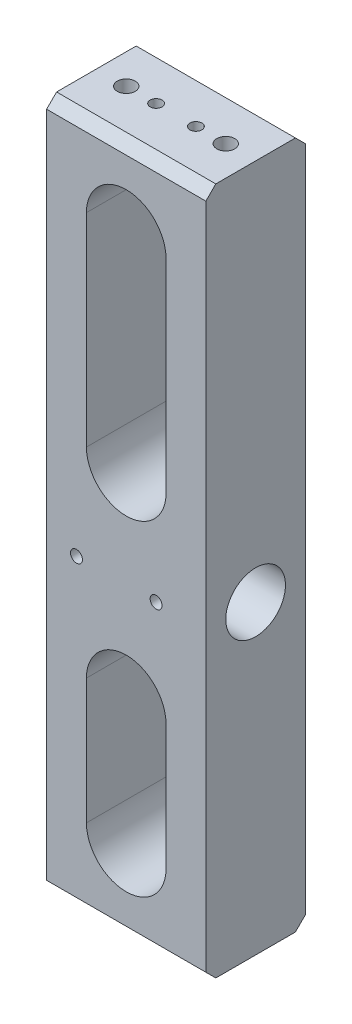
ISO-10303-21;
HEADER;
FILE_DESCRIPTION(('STEP AP214'),'2;1');
FILE_NAME('part.step','',(''),(''),'','','');
FILE_SCHEMA(('AUTOMOTIVE_DESIGN { 1 0 10303 214 1 1 1 1 }'));
ENDSEC;
DATA;
#1=APPLICATION_CONTEXT('core data for automotive mechanical design processes');
#2=APPLICATION_PROTOCOL_DEFINITION('international standard','automotive_design',2000,#1);
#3=PRODUCT_CONTEXT('',#1,'mechanical');
#4=PRODUCT('Part','Part','',(#3));
#5=PRODUCT_RELATED_PRODUCT_CATEGORY('part','',(#4));
#6=PRODUCT_DEFINITION_FORMATION('','',#4);
#7=PRODUCT_DEFINITION_CONTEXT('part definition',#1,'design');
#8=PRODUCT_DEFINITION('design','',#6,#7);
#9=PRODUCT_DEFINITION_SHAPE('','',#8);
#10=(LENGTH_UNIT() NAMED_UNIT(*) SI_UNIT(.MILLI.,.METRE.));
#11=(NAMED_UNIT(*) PLANE_ANGLE_UNIT() SI_UNIT($,.RADIAN.));
#12=(NAMED_UNIT(*) SI_UNIT($,.STERADIAN.) SOLID_ANGLE_UNIT());
#13=UNCERTAINTY_MEASURE_WITH_UNIT(LENGTH_MEASURE(1.E-05),#10,'distance_accuracy_value','');
#14=(GEOMETRIC_REPRESENTATION_CONTEXT(3) GLOBAL_UNCERTAINTY_ASSIGNED_CONTEXT((#13)) GLOBAL_UNIT_ASSIGNED_CONTEXT((#10,
#11,#12)) REPRESENTATION_CONTEXT('',''));
#15=CARTESIAN_POINT('',(0.,0.,0.));
#16=DIRECTION('',(0.,0.,1.));
#17=DIRECTION('',(1.,0.,0.));
#18=AXIS2_PLACEMENT_3D('',#15,#16,#17);
#19=CARTESIAN_POINT('',(0.,0.,25.));
#20=DIRECTION('',(0.,0.,1.));
#21=DIRECTION('',(1.,0.,0.));
#22=AXIS2_PLACEMENT_3D('',#19,#20,#21);
#23=PLANE('',#22);
#24=CARTESIAN_POINT('',(15.,0.,25.));
#25=DIRECTION('',(0.,0.,-1.));
#26=DIRECTION('',(-1.,0.,0.));
#27=AXIS2_PLACEMENT_3D('',#24,#25,#26);
#28=CIRCLE('',#27,3.);
#29=CARTESIAN_POINT('',(12.,0.,25.));
#30=VERTEX_POINT('',#29);
#31=EDGE_CURVE('E220',#30,#30,#28,.T.);
#32=ORIENTED_EDGE('',*,*,#31,.T.);
#33=EDGE_LOOP('',(#32));
#34=FACE_BOUND('',#33,.T.);
#35=CARTESIAN_POINT('',(-25.,0.,25.));
#36=DIRECTION('',(0.,0.,-1.));
#37=DIRECTION('',(-1.,0.,0.));
#38=AXIS2_PLACEMENT_3D('',#35,#36,#37);
#39=CIRCLE('',#38,3.);
#40=CARTESIAN_POINT('',(-28.,0.,25.));
#41=VERTEX_POINT('',#40);
#42=EDGE_CURVE('E226',#41,#41,#39,.T.);
#43=ORIENTED_EDGE('',*,*,#42,.T.);
#44=EDGE_LOOP('',(#43));
#45=FACE_BOUND('',#44,.T.);
#46=DIRECTION('',(0.,-1.,0.));
#47=VECTOR('',#46,1.);
#48=CARTESIAN_POINT('',(-20.,152.,25.));
#49=LINE('',#48,#47);
#50=CARTESIAN_POINT('',(-20.,152.,25.));
#51=VERTEX_POINT('',#50);
#52=CARTESIAN_POINT('',(-20.,50.,25.));
#53=VERTEX_POINT('',#52);
#54=EDGE_CURVE('E275',#51,#53,#49,.T.);
#55=ORIENTED_EDGE('',*,*,#54,.F.);
#56=CARTESIAN_POINT('',(0.,152.,25.));
#57=DIRECTION('',(0.,0.,1.));
#58=DIRECTION('',(1.,0.,0.));
#59=AXIS2_PLACEMENT_3D('',#56,#57,#58);
#60=CIRCLE('',#59,20.);
#61=CARTESIAN_POINT('',(20.,152.,25.));
#62=VERTEX_POINT('',#61);
#63=EDGE_CURVE('E273',#62,#51,#60,.T.);
#64=ORIENTED_EDGE('',*,*,#63,.F.);
#65=DIRECTION('',(0.,1.,0.));
#66=VECTOR('',#65,1.);
#67=CARTESIAN_POINT('',(20.,152.,25.));
#68=LINE('',#67,#66);
#69=CARTESIAN_POINT('',(20.,50.,25.));
#70=VERTEX_POINT('',#69);
#71=EDGE_CURVE('E281',#70,#62,#68,.T.);
#72=ORIENTED_EDGE('',*,*,#71,.F.);
#73=CARTESIAN_POINT('',(0.,50.,25.));
#74=DIRECTION('',(0.,0.,1.));
#75=DIRECTION('',(1.,0.,0.));
#76=AXIS2_PLACEMENT_3D('',#73,#74,#75);
#77=CIRCLE('',#76,20.);
#78=EDGE_CURVE('E278',#53,#70,#77,.T.);
#79=ORIENTED_EDGE('',*,*,#78,.F.);
#80=EDGE_LOOP('',(#55,#64,#72,#79));
#81=FACE_BOUND('',#80,.T.);
#82=DIRECTION('',(0.,1.,0.));
#83=VECTOR('',#82,1.);
#84=CARTESIAN_POINT('',(40.,192.,25.));
#85=LINE('',#84,#83);
#86=CARTESIAN_POINT('',(40.,-148.5,25.));
#87=VERTEX_POINT('',#86);
#88=CARTESIAN_POINT('',(40.,187.,25.));
#89=VERTEX_POINT('',#88);
#90=EDGE_CURVE('E307',#87,#89,#85,.T.);
#91=ORIENTED_EDGE('',*,*,#90,.T.);
#92=DIRECTION('',(-1.,0.,0.));
#93=VECTOR('',#92,1.);
#94=CARTESIAN_POINT('',(-40.,187.,25.));
#95=LINE('',#94,#93);
#96=CARTESIAN_POINT('',(-40.,187.,25.));
#97=VERTEX_POINT('',#96);
#98=EDGE_CURVE('E329',#89,#97,#95,.T.);
#99=ORIENTED_EDGE('',*,*,#98,.T.);
#100=DIRECTION('',(0.,-1.,0.));
#101=VECTOR('',#100,1.);
#102=CARTESIAN_POINT('',(-40.,192.,25.));
#103=LINE('',#102,#101);
#104=CARTESIAN_POINT('',(-40.,-148.5,25.));
#105=VERTEX_POINT('',#104);
#106=EDGE_CURVE('E304',#97,#105,#103,.T.);
#107=ORIENTED_EDGE('',*,*,#106,.T.);
#108=DIRECTION('',(1.,0.,0.));
#109=VECTOR('',#108,1.);
#110=CARTESIAN_POINT('',(40.,-148.5,25.));
#111=LINE('',#110,#109);
#112=EDGE_CURVE('E326',#105,#87,#111,.T.);
#113=ORIENTED_EDGE('',*,*,#112,.T.);
#114=EDGE_LOOP('',(#91,#99,#107,#113));
#115=FACE_BOUND('',#114,.T.);
#116=DIRECTION('',(0.,-1.,0.));
#117=VECTOR('',#116,1.);
#118=CARTESIAN_POINT('',(-20.,-50.5,25.));
#119=LINE('',#118,#117);
#120=CARTESIAN_POINT('',(-20.,-50.5,25.));
#121=VERTEX_POINT('',#120);
#122=CARTESIAN_POINT('',(-20.,-113.5,25.));
#123=VERTEX_POINT('',#122);
#124=EDGE_CURVE('E244',#121,#123,#119,.T.);
#125=ORIENTED_EDGE('',*,*,#124,.F.);
#126=CARTESIAN_POINT('',(0.,-50.5,25.));
#127=DIRECTION('',(0.,0.,1.));
#128=DIRECTION('',(1.,0.,0.));
#129=AXIS2_PLACEMENT_3D('',#126,#127,#128);
#130=CIRCLE('',#129,20.);
#131=CARTESIAN_POINT('',(20.,-50.5,25.));
#132=VERTEX_POINT('',#131);
#133=EDGE_CURVE('E242',#132,#121,#130,.T.);
#134=ORIENTED_EDGE('',*,*,#133,.F.);
#135=DIRECTION('',(0.,1.,0.));
#136=VECTOR('',#135,1.);
#137=CARTESIAN_POINT('',(20.,-50.5,25.));
#138=LINE('',#137,#136);
#139=CARTESIAN_POINT('',(20.,-113.5,25.));
#140=VERTEX_POINT('',#139);
#141=EDGE_CURVE('E250',#140,#132,#138,.T.);
#142=ORIENTED_EDGE('',*,*,#141,.F.);
#143=CARTESIAN_POINT('',(0.,-113.5,25.));
#144=DIRECTION('',(0.,0.,1.));
#145=DIRECTION('',(1.,0.,0.));
#146=AXIS2_PLACEMENT_3D('',#143,#144,#145);
#147=CIRCLE('',#146,20.);
#148=EDGE_CURVE('E247',#123,#140,#147,.T.);
#149=ORIENTED_EDGE('',*,*,#148,.F.);
#150=EDGE_LOOP('',(#125,#134,#142,#149));
#151=FACE_BOUND('',#150,.T.);
#152=ADVANCED_FACE('F39',(#34,#45,#81,#115,#151),#23,.T.);
#153=CARTESIAN_POINT('',(0.,0.,-25.));
#154=DIRECTION('',(0.,0.,1.));
#155=DIRECTION('',(1.,0.,0.));
#156=AXIS2_PLACEMENT_3D('',#153,#154,#155);
#157=PLANE('',#156);
#158=CARTESIAN_POINT('',(15.,0.,-25.));
#159=DIRECTION('',(0.,0.,-1.));
#160=DIRECTION('',(-1.,0.,0.));
#161=AXIS2_PLACEMENT_3D('',#158,#159,#160);
#162=CIRCLE('',#161,3.);
#163=CARTESIAN_POINT('',(12.,0.,-25.));
#164=VERTEX_POINT('',#163);
#165=EDGE_CURVE('E219',#164,#164,#162,.T.);
#166=ORIENTED_EDGE('',*,*,#165,.F.);
#167=EDGE_LOOP('',(#166));
#168=FACE_BOUND('',#167,.T.);
#169=CARTESIAN_POINT('',(-25.,0.,-25.));
#170=DIRECTION('',(0.,0.,-1.));
#171=DIRECTION('',(-1.,0.,0.));
#172=AXIS2_PLACEMENT_3D('',#169,#170,#171);
#173=CIRCLE('',#172,3.);
#174=CARTESIAN_POINT('',(-28.,0.,-25.));
#175=VERTEX_POINT('',#174);
#176=EDGE_CURVE('E230',#175,#175,#173,.T.);
#177=ORIENTED_EDGE('',*,*,#176,.F.);
#178=EDGE_LOOP('',(#177));
#179=FACE_BOUND('',#178,.T.);
#180=CARTESIAN_POINT('',(0.,152.,-25.));
#181=DIRECTION('',(0.,0.,1.));
#182=DIRECTION('',(1.,0.,0.));
#183=AXIS2_PLACEMENT_3D('',#180,#181,#182);
#184=CIRCLE('',#183,20.);
#185=CARTESIAN_POINT('',(20.,152.,-25.));
#186=VERTEX_POINT('',#185);
#187=CARTESIAN_POINT('',(-20.,152.,-25.));
#188=VERTEX_POINT('',#187);
#189=EDGE_CURVE('E272',#186,#188,#184,.T.);
#190=ORIENTED_EDGE('',*,*,#189,.T.);
#191=DIRECTION('',(0.,-1.,0.));
#192=VECTOR('',#191,1.);
#193=CARTESIAN_POINT('',(-20.,152.,-25.));
#194=LINE('',#193,#192);
#195=CARTESIAN_POINT('',(-20.,50.,-25.));
#196=VERTEX_POINT('',#195);
#197=EDGE_CURVE('E286',#188,#196,#194,.T.);
#198=ORIENTED_EDGE('',*,*,#197,.T.);
#199=CARTESIAN_POINT('',(0.,50.,-25.));
#200=DIRECTION('',(0.,0.,1.));
#201=DIRECTION('',(1.,0.,0.));
#202=AXIS2_PLACEMENT_3D('',#199,#200,#201);
#203=CIRCLE('',#202,20.);
#204=CARTESIAN_POINT('',(20.,50.,-25.));
#205=VERTEX_POINT('',#204);
#206=EDGE_CURVE('E289',#196,#205,#203,.T.);
#207=ORIENTED_EDGE('',*,*,#206,.T.);
#208=DIRECTION('',(0.,1.,0.));
#209=VECTOR('',#208,1.);
#210=CARTESIAN_POINT('',(20.,152.,-25.));
#211=LINE('',#210,#209);
#212=EDGE_CURVE('E276',#205,#186,#211,.T.);
#213=ORIENTED_EDGE('',*,*,#212,.T.);
#214=EDGE_LOOP('',(#190,#198,#207,#213));
#215=FACE_BOUND('',#214,.T.);
#216=DIRECTION('',(0.,-1.,0.));
#217=VECTOR('',#216,1.);
#218=CARTESIAN_POINT('',(-40.,192.,-25.));
#219=LINE('',#218,#217);
#220=CARTESIAN_POINT('',(-40.,187.,-25.));
#221=VERTEX_POINT('',#220);
#222=CARTESIAN_POINT('',(-40.,-148.5,-25.));
#223=VERTEX_POINT('',#222);
#224=EDGE_CURVE('E303',#221,#223,#219,.T.);
#225=ORIENTED_EDGE('',*,*,#224,.F.);
#226=DIRECTION('',(1.,0.,0.));
#227=VECTOR('',#226,1.);
#228=CARTESIAN_POINT('',(0.,187.,-25.));
#229=LINE('',#228,#227);
#230=CARTESIAN_POINT('',(40.,187.,-25.));
#231=VERTEX_POINT('',#230);
#232=EDGE_CURVE('E353',#221,#231,#229,.T.);
#233=ORIENTED_EDGE('',*,*,#232,.T.);
#234=DIRECTION('',(0.,1.,0.));
#235=VECTOR('',#234,1.);
#236=CARTESIAN_POINT('',(40.,192.,-25.));
#237=LINE('',#236,#235);
#238=CARTESIAN_POINT('',(40.,-148.5,-25.));
#239=VERTEX_POINT('',#238);
#240=EDGE_CURVE('E308',#239,#231,#237,.T.);
#241=ORIENTED_EDGE('',*,*,#240,.F.);
#242=DIRECTION('',(-1.,0.,0.));
#243=VECTOR('',#242,1.);
#244=CARTESIAN_POINT('',(0.,-148.5,-25.));
#245=LINE('',#244,#243);
#246=EDGE_CURVE('E351',#239,#223,#245,.T.);
#247=ORIENTED_EDGE('',*,*,#246,.T.);
#248=EDGE_LOOP('',(#225,#233,#241,#247));
#249=FACE_BOUND('',#248,.T.);
#250=CARTESIAN_POINT('',(0.,-50.5,-25.));
#251=DIRECTION('',(0.,0.,1.));
#252=DIRECTION('',(1.,0.,0.));
#253=AXIS2_PLACEMENT_3D('',#250,#251,#252);
#254=CIRCLE('',#253,20.);
#255=CARTESIAN_POINT('',(20.,-50.5,-25.));
#256=VERTEX_POINT('',#255);
#257=CARTESIAN_POINT('',(-20.,-50.5,-25.));
#258=VERTEX_POINT('',#257);
#259=EDGE_CURVE('E241',#256,#258,#254,.T.);
#260=ORIENTED_EDGE('',*,*,#259,.T.);
#261=DIRECTION('',(0.,-1.,0.));
#262=VECTOR('',#261,1.);
#263=CARTESIAN_POINT('',(-20.,-50.5,-25.));
#264=LINE('',#263,#262);
#265=CARTESIAN_POINT('',(-20.,-113.5,-25.));
#266=VERTEX_POINT('',#265);
#267=EDGE_CURVE('E255',#258,#266,#264,.T.);
#268=ORIENTED_EDGE('',*,*,#267,.T.);
#269=CARTESIAN_POINT('',(0.,-113.5,-25.));
#270=DIRECTION('',(0.,0.,1.));
#271=DIRECTION('',(1.,0.,0.));
#272=AXIS2_PLACEMENT_3D('',#269,#270,#271);
#273=CIRCLE('',#272,20.);
#274=CARTESIAN_POINT('',(20.,-113.5,-25.));
#275=VERTEX_POINT('',#274);
#276=EDGE_CURVE('E258',#266,#275,#273,.T.);
#277=ORIENTED_EDGE('',*,*,#276,.T.);
#278=DIRECTION('',(0.,1.,0.));
#279=VECTOR('',#278,1.);
#280=CARTESIAN_POINT('',(20.,-50.5,-25.));
#281=LINE('',#280,#279);
#282=EDGE_CURVE('E245',#275,#256,#281,.T.);
#283=ORIENTED_EDGE('',*,*,#282,.T.);
#284=EDGE_LOOP('',(#260,#268,#277,#283));
#285=FACE_BOUND('',#284,.T.);
#286=ADVANCED_FACE('F401',(#168,#179,#215,#249,#285),#157,.F.);
#287=CARTESIAN_POINT('',(-40.,192.,25.));
#288=DIRECTION('',(1.,0.,0.));
#289=DIRECTION('',(0.,1.,0.));
#290=AXIS2_PLACEMENT_3D('',#287,#288,#289);
#291=PLANE('',#290);
#292=CARTESIAN_POINT('',(-40.,0.,0.));
#293=DIRECTION('',(-1.,0.,0.));
#294=DIRECTION('',(0.,-1.,0.));
#295=AXIS2_PLACEMENT_3D('',#292,#293,#294);
#296=CIRCLE('',#295,15.);
#297=CARTESIAN_POINT('',(-40.,-15.,0.));
#298=VERTEX_POINT('',#297);
#299=EDGE_CURVE('E234',#298,#298,#296,.T.);
#300=ORIENTED_EDGE('',*,*,#299,.F.);
#301=EDGE_LOOP('',(#300));
#302=FACE_BOUND('',#301,.T.);
#303=ORIENTED_EDGE('',*,*,#106,.F.);
#304=DIRECTION('',(0.,0.707106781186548,-0.707106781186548));
#305=VECTOR('',#304,1.);
#306=CARTESIAN_POINT('',(-40.,187.,25.));
#307=LINE('',#306,#305);
#308=CARTESIAN_POINT('',(-40.,192.,20.));
#309=VERTEX_POINT('',#308);
#310=EDGE_CURVE('E338',#97,#309,#307,.T.);
#311=ORIENTED_EDGE('',*,*,#310,.T.);
#312=DIRECTION('',(0.,0.,-1.));
#313=VECTOR('',#312,1.);
#314=CARTESIAN_POINT('',(-40.,192.,25.));
#315=LINE('',#314,#313);
#316=CARTESIAN_POINT('',(-40.,192.,-19.9999999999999));
#317=VERTEX_POINT('',#316);
#318=EDGE_CURVE('E311',#309,#317,#315,.T.);
#319=ORIENTED_EDGE('',*,*,#318,.T.);
#320=DIRECTION('',(0.,0.707106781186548,0.707106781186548));
#321=VECTOR('',#320,1.);
#322=CARTESIAN_POINT('',(-40.,192.,-19.9999999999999));
#323=LINE('',#322,#321);
#324=EDGE_CURVE('E336',#317,#221,#323,.F.);
#325=ORIENTED_EDGE('',*,*,#324,.T.);
#326=ORIENTED_EDGE('',*,*,#224,.T.);
#327=DIRECTION('',(0.,0.707106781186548,-0.707106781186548));
#328=VECTOR('',#327,1.);
#329=CARTESIAN_POINT('',(-40.,-153.5,-19.9999999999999));
#330=LINE('',#329,#328);
#331=CARTESIAN_POINT('',(-40.,-153.5,-19.9999999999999));
#332=VERTEX_POINT('',#331);
#333=EDGE_CURVE('E332',#223,#332,#330,.F.);
#334=ORIENTED_EDGE('',*,*,#333,.T.);
#335=DIRECTION('',(0.,0.,-1.));
#336=VECTOR('',#335,1.);
#337=CARTESIAN_POINT('',(-40.,-153.5,25.));
#338=LINE('',#337,#336);
#339=CARTESIAN_POINT('',(-40.,-153.5,19.9999999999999));
#340=VERTEX_POINT('',#339);
#341=EDGE_CURVE('E323',#340,#332,#338,.T.);
#342=ORIENTED_EDGE('',*,*,#341,.F.);
#343=DIRECTION('',(0.,0.707106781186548,0.707106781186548));
#344=VECTOR('',#343,1.);
#345=CARTESIAN_POINT('',(-40.,-148.5,25.));
#346=LINE('',#345,#344);
#347=EDGE_CURVE('E334',#340,#105,#346,.T.);
#348=ORIENTED_EDGE('',*,*,#347,.T.);
#349=EDGE_LOOP('',(#303,#311,#319,#325,#326,#334,#342,#348));
#350=FACE_BOUND('',#349,.T.);
#351=ADVANCED_FACE('F407',(#302,#350),#291,.F.);
#352=CARTESIAN_POINT('',(-40.,-153.5,25.));
#353=DIRECTION('',(0.,1.,0.));
#354=DIRECTION('',(0.,0.,1.));
#355=AXIS2_PLACEMENT_3D('',#352,#353,#354);
#356=PLANE('',#355);
#357=CARTESIAN_POINT('',(-33.,-153.5,0.));
#358=DIRECTION('',(0.,-1.,0.));
#359=DIRECTION('',(0.,0.,-1.));
#360=AXIS2_PLACEMENT_3D('',#357,#358,#359);
#361=CIRCLE('',#360,5.5);
#362=CARTESIAN_POINT('',(-33.,-153.5,-5.5));
#363=VERTEX_POINT('',#362);
#364=EDGE_CURVE('E182',#363,#363,#361,.T.);
#365=ORIENTED_EDGE('',*,*,#364,.F.);
#366=EDGE_LOOP('',(#365));
#367=FACE_BOUND('',#366,.T.);
#368=CARTESIAN_POINT('',(28.,-153.5,0.));
#369=DIRECTION('',(0.,-1.,0.));
#370=DIRECTION('',(0.,0.,-1.));
#371=AXIS2_PLACEMENT_3D('',#368,#369,#370);
#372=CIRCLE('',#371,6.25);
#373=CARTESIAN_POINT('',(28.,-153.5,-6.25000000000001));
#374=VERTEX_POINT('',#373);
#375=EDGE_CURVE('E181',#374,#374,#372,.T.);
#376=ORIENTED_EDGE('',*,*,#375,.F.);
#377=EDGE_LOOP('',(#376));
#378=FACE_BOUND('',#377,.T.);
#379=DIRECTION('',(0.,0.,-1.));
#380=VECTOR('',#379,1.);
#381=CARTESIAN_POINT('',(40.,-153.5,25.));
#382=LINE('',#381,#380);
#383=CARTESIAN_POINT('',(40.,-153.5,19.9999999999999));
#384=VERTEX_POINT('',#383);
#385=CARTESIAN_POINT('',(40.,-153.5,-19.9999999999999));
#386=VERTEX_POINT('',#385);
#387=EDGE_CURVE('E321',#384,#386,#382,.T.);
#388=ORIENTED_EDGE('',*,*,#387,.F.);
#389=DIRECTION('',(-1.,0.,0.));
#390=VECTOR('',#389,1.);
#391=CARTESIAN_POINT('',(-40.,-153.5,19.9999999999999));
#392=LINE('',#391,#390);
#393=EDGE_CURVE('E11',#384,#340,#392,.T.);
#394=ORIENTED_EDGE('',*,*,#393,.T.);
#395=ORIENTED_EDGE('',*,*,#341,.T.);
#396=DIRECTION('',(1.,0.,0.));
#397=VECTOR('',#396,1.);
#398=CARTESIAN_POINT('',(-40.,-153.5,-19.9999999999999));
#399=LINE('',#398,#397);
#400=EDGE_CURVE('E48',#332,#386,#399,.T.);
#401=ORIENTED_EDGE('',*,*,#400,.T.);
#402=EDGE_LOOP('',(#388,#394,#395,#401));
#403=FACE_BOUND('',#402,.T.);
#404=ADVANCED_FACE('F422',(#367,#378,#403),#356,.F.);
#405=CARTESIAN_POINT('',(40.,192.,25.));
#406=DIRECTION('',(-1.,0.,0.));
#407=DIRECTION('',(0.,-1.,0.));
#408=AXIS2_PLACEMENT_3D('',#405,#406,#407);
#409=PLANE('',#408);
#410=CARTESIAN_POINT('',(40.,0.,0.));
#411=DIRECTION('',(-1.,0.,0.));
#412=DIRECTION('',(0.,-1.,0.));
#413=AXIS2_PLACEMENT_3D('',#410,#411,#412);
#414=CIRCLE('',#413,15.);
#415=CARTESIAN_POINT('',(40.,-15.,0.));
#416=VERTEX_POINT('',#415);
#417=EDGE_CURVE('E237',#416,#416,#414,.F.);
#418=ORIENTED_EDGE('',*,*,#417,.F.);
#419=EDGE_LOOP('',(#418));
#420=FACE_BOUND('',#419,.T.);
#421=DIRECTION('',(0.,0.,-1.));
#422=VECTOR('',#421,1.);
#423=CARTESIAN_POINT('',(40.,192.,25.));
#424=LINE('',#423,#422);
#425=CARTESIAN_POINT('',(40.,192.,20.));
#426=VERTEX_POINT('',#425);
#427=CARTESIAN_POINT('',(40.,192.,-19.9999999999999));
#428=VERTEX_POINT('',#427);
#429=EDGE_CURVE('E318',#426,#428,#424,.T.);
#430=ORIENTED_EDGE('',*,*,#429,.F.);
#431=DIRECTION('',(0.,-0.707106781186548,0.707106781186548));
#432=VECTOR('',#431,1.);
#433=CARTESIAN_POINT('',(40.,187.,25.));
#434=LINE('',#433,#432);
#435=EDGE_CURVE('E349',#426,#89,#434,.T.);
#436=ORIENTED_EDGE('',*,*,#435,.T.);
#437=ORIENTED_EDGE('',*,*,#90,.F.);
#438=DIRECTION('',(0.,-0.707106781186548,-0.707106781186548));
#439=VECTOR('',#438,1.);
#440=CARTESIAN_POINT('',(40.,-148.5,25.));
#441=LINE('',#440,#439);
#442=EDGE_CURVE('E64',#87,#384,#441,.T.);
#443=ORIENTED_EDGE('',*,*,#442,.T.);
#444=ORIENTED_EDGE('',*,*,#387,.T.);
#445=DIRECTION('',(0.,-0.707106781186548,0.707106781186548));
#446=VECTOR('',#445,1.);
#447=CARTESIAN_POINT('',(40.,-153.5,-19.9999999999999));
#448=LINE('',#447,#446);
#449=EDGE_CURVE('E56',#386,#239,#448,.F.);
#450=ORIENTED_EDGE('',*,*,#449,.T.);
#451=ORIENTED_EDGE('',*,*,#240,.T.);
#452=DIRECTION('',(0.,-0.707106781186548,-0.707106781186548));
#453=VECTOR('',#452,1.);
#454=CARTESIAN_POINT('',(40.,192.,-19.9999999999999));
#455=LINE('',#454,#453);
#456=EDGE_CURVE('E347',#231,#428,#455,.F.);
#457=ORIENTED_EDGE('',*,*,#456,.T.);
#458=EDGE_LOOP('',(#430,#436,#437,#443,#444,#450,#451,#457));
#459=FACE_BOUND('',#458,.T.);
#460=ADVANCED_FACE('F418',(#420,#459),#409,.F.);
#461=CARTESIAN_POINT('',(-40.,192.,25.));
#462=DIRECTION('',(0.,-1.,0.));
#463=DIRECTION('',(0.,0.,-1.));
#464=AXIS2_PLACEMENT_3D('',#461,#462,#463);
#465=PLANE('',#464);
#466=CARTESIAN_POINT('',(-9.99999999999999,192.,0.));
#467=DIRECTION('',(0.,1.,0.));
#468=DIRECTION('',(0.,0.,1.));
#469=AXIS2_PLACEMENT_3D('',#466,#467,#468);
#470=CIRCLE('',#469,3.);
#471=CARTESIAN_POINT('',(-9.99999999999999,192.,3.));
#472=VERTEX_POINT('',#471);
#473=EDGE_CURVE('E195',#472,#472,#470,.T.);
#474=ORIENTED_EDGE('',*,*,#473,.F.);
#475=EDGE_LOOP('',(#474));
#476=FACE_BOUND('',#475,.T.);
#477=CARTESIAN_POINT('',(10.,192.,0.));
#478=DIRECTION('',(0.,1.,0.));
#479=DIRECTION('',(0.,0.,1.));
#480=AXIS2_PLACEMENT_3D('',#477,#478,#479);
#481=CIRCLE('',#480,3.);
#482=CARTESIAN_POINT('',(10.,192.,3.));
#483=VERTEX_POINT('',#482);
#484=EDGE_CURVE('E201',#483,#483,#481,.T.);
#485=ORIENTED_EDGE('',*,*,#484,.F.);
#486=EDGE_LOOP('',(#485));
#487=FACE_BOUND('',#486,.T.);
#488=CARTESIAN_POINT('',(25.,192.,0.));
#489=DIRECTION('',(0.,1.,0.));
#490=DIRECTION('',(0.,0.,1.));
#491=AXIS2_PLACEMENT_3D('',#488,#489,#490);
#492=CIRCLE('',#491,4.5);
#493=CARTESIAN_POINT('',(25.,192.,4.49999999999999));
#494=VERTEX_POINT('',#493);
#495=EDGE_CURVE('E207',#494,#494,#492,.T.);
#496=ORIENTED_EDGE('',*,*,#495,.F.);
#497=EDGE_LOOP('',(#496));
#498=FACE_BOUND('',#497,.T.);
#499=CARTESIAN_POINT('',(-25.,192.,0.));
#500=DIRECTION('',(0.,1.,0.));
#501=DIRECTION('',(0.,0.,1.));
#502=AXIS2_PLACEMENT_3D('',#499,#500,#501);
#503=CIRCLE('',#502,4.5);
#504=CARTESIAN_POINT('',(-25.,192.,4.5));
#505=VERTEX_POINT('',#504);
#506=EDGE_CURVE('E213',#505,#505,#503,.T.);
#507=ORIENTED_EDGE('',*,*,#506,.F.);
#508=EDGE_LOOP('',(#507));
#509=FACE_BOUND('',#508,.T.);
#510=ORIENTED_EDGE('',*,*,#318,.F.);
#511=DIRECTION('',(1.,0.,0.));
#512=VECTOR('',#511,1.);
#513=CARTESIAN_POINT('',(40.,192.,20.));
#514=LINE('',#513,#512);
#515=EDGE_CURVE('E343',#309,#426,#514,.T.);
#516=ORIENTED_EDGE('',*,*,#515,.T.);
#517=ORIENTED_EDGE('',*,*,#429,.T.);
#518=DIRECTION('',(-1.,0.,0.));
#519=VECTOR('',#518,1.);
#520=CARTESIAN_POINT('',(-40.,192.,-19.9999999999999));
#521=LINE('',#520,#519);
#522=EDGE_CURVE('E340',#428,#317,#521,.T.);
#523=ORIENTED_EDGE('',*,*,#522,.T.);
#524=EDGE_LOOP('',(#510,#516,#517,#523));
#525=FACE_BOUND('',#524,.T.);
#526=ADVANCED_FACE('F415',(#476,#487,#498,#509,#525),#465,.F.);
#527=CARTESIAN_POINT('',(0.,152.,25.));
#528=DIRECTION('',(0.,0.,-1.));
#529=DIRECTION('',(-1.,0.,0.));
#530=AXIS2_PLACEMENT_3D('',#527,#528,#529);
#531=CYLINDRICAL_SURFACE('',#530,20.);
#532=ORIENTED_EDGE('',*,*,#189,.F.);
#533=DIRECTION('',(0.,0.,-1.));
#534=VECTOR('',#533,1.);
#535=CARTESIAN_POINT('',(20.,152.,25.));
#536=LINE('',#535,#534);
#537=EDGE_CURVE('E283',#62,#186,#536,.T.);
#538=ORIENTED_EDGE('',*,*,#537,.F.);
#539=ORIENTED_EDGE('',*,*,#63,.T.);
#540=DIRECTION('',(0.,0.,-1.));
#541=VECTOR('',#540,1.);
#542=CARTESIAN_POINT('',(-20.,152.,25.));
#543=LINE('',#542,#541);
#544=EDGE_CURVE('E300',#51,#188,#543,.T.);
#545=ORIENTED_EDGE('',*,*,#544,.T.);
#546=EDGE_LOOP('',(#532,#538,#539,#545));
#547=FACE_BOUND('',#546,.T.);
#548=ADVANCED_FACE('F412',(#547),#531,.F.);
#549=CARTESIAN_POINT('',(-20.,152.,25.));
#550=DIRECTION('',(1.,0.,0.));
#551=DIRECTION('',(0.,1.,0.));
#552=AXIS2_PLACEMENT_3D('',#549,#550,#551);
#553=PLANE('',#552);
#554=ORIENTED_EDGE('',*,*,#197,.F.);
#555=ORIENTED_EDGE('',*,*,#544,.F.);
#556=ORIENTED_EDGE('',*,*,#54,.T.);
#557=DIRECTION('',(0.,0.,-1.));
#558=VECTOR('',#557,1.);
#559=CARTESIAN_POINT('',(-20.,50.,25.));
#560=LINE('',#559,#558);
#561=EDGE_CURVE('E298',#53,#196,#560,.T.);
#562=ORIENTED_EDGE('',*,*,#561,.T.);
#563=EDGE_LOOP('',(#554,#555,#556,#562));
#564=FACE_BOUND('',#563,.T.);
#565=ADVANCED_FACE('F499',(#564),#553,.T.);
#566=CARTESIAN_POINT('',(0.,50.,25.));
#567=DIRECTION('',(0.,0.,-1.));
#568=DIRECTION('',(-1.,0.,0.));
#569=AXIS2_PLACEMENT_3D('',#566,#567,#568);
#570=CYLINDRICAL_SURFACE('',#569,20.);
#571=ORIENTED_EDGE('',*,*,#206,.F.);
#572=ORIENTED_EDGE('',*,*,#561,.F.);
#573=ORIENTED_EDGE('',*,*,#78,.T.);
#574=DIRECTION('',(0.,0.,-1.));
#575=VECTOR('',#574,1.);
#576=CARTESIAN_POINT('',(20.,50.,25.));
#577=LINE('',#576,#575);
#578=EDGE_CURVE('E296',#70,#205,#577,.T.);
#579=ORIENTED_EDGE('',*,*,#578,.T.);
#580=EDGE_LOOP('',(#571,#572,#573,#579));
#581=FACE_BOUND('',#580,.T.);
#582=ADVANCED_FACE('F496',(#581),#570,.F.);
#583=CARTESIAN_POINT('',(20.,152.,25.));
#584=DIRECTION('',(-1.,0.,0.));
#585=DIRECTION('',(0.,-1.,0.));
#586=AXIS2_PLACEMENT_3D('',#583,#584,#585);
#587=PLANE('',#586);
#588=ORIENTED_EDGE('',*,*,#212,.F.);
#589=ORIENTED_EDGE('',*,*,#578,.F.);
#590=ORIENTED_EDGE('',*,*,#71,.T.);
#591=ORIENTED_EDGE('',*,*,#537,.T.);
#592=EDGE_LOOP('',(#588,#589,#590,#591));
#593=FACE_BOUND('',#592,.T.);
#594=ADVANCED_FACE('F493',(#593),#587,.T.);
#595=CARTESIAN_POINT('',(0.,-50.5,25.));
#596=DIRECTION('',(0.,0.,-1.));
#597=DIRECTION('',(-1.,0.,0.));
#598=AXIS2_PLACEMENT_3D('',#595,#596,#597);
#599=CYLINDRICAL_SURFACE('',#598,20.);
#600=ORIENTED_EDGE('',*,*,#259,.F.);
#601=DIRECTION('',(0.,0.,-1.));
#602=VECTOR('',#601,1.);
#603=CARTESIAN_POINT('',(20.,-50.5,25.));
#604=LINE('',#603,#602);
#605=EDGE_CURVE('E252',#132,#256,#604,.T.);
#606=ORIENTED_EDGE('',*,*,#605,.F.);
#607=ORIENTED_EDGE('',*,*,#133,.T.);
#608=DIRECTION('',(0.,0.,-1.));
#609=VECTOR('',#608,1.);
#610=CARTESIAN_POINT('',(-20.,-50.5,25.));
#611=LINE('',#610,#609);
#612=EDGE_CURVE('E269',#121,#258,#611,.T.);
#613=ORIENTED_EDGE('',*,*,#612,.T.);
#614=EDGE_LOOP('',(#600,#606,#607,#613));
#615=FACE_BOUND('',#614,.T.);
#616=ADVANCED_FACE('F470',(#615),#599,.F.);
#617=CARTESIAN_POINT('',(-20.,-50.5,25.));
#618=DIRECTION('',(1.,0.,0.));
#619=DIRECTION('',(0.,1.,0.));
#620=AXIS2_PLACEMENT_3D('',#617,#618,#619);
#621=PLANE('',#620);
#622=ORIENTED_EDGE('',*,*,#267,.F.);
#623=ORIENTED_EDGE('',*,*,#612,.F.);
#624=ORIENTED_EDGE('',*,*,#124,.T.);
#625=DIRECTION('',(0.,0.,-1.));
#626=VECTOR('',#625,1.);
#627=CARTESIAN_POINT('',(-20.,-113.5,25.));
#628=LINE('',#627,#626);
#629=EDGE_CURVE('E267',#123,#266,#628,.T.);
#630=ORIENTED_EDGE('',*,*,#629,.T.);
#631=EDGE_LOOP('',(#622,#623,#624,#630));
#632=FACE_BOUND('',#631,.T.);
#633=ADVANCED_FACE('F478',(#632),#621,.T.);
#634=CARTESIAN_POINT('',(0.,-113.5,25.));
#635=DIRECTION('',(0.,0.,-1.));
#636=DIRECTION('',(-1.,0.,0.));
#637=AXIS2_PLACEMENT_3D('',#634,#635,#636);
#638=CYLINDRICAL_SURFACE('',#637,20.);
#639=ORIENTED_EDGE('',*,*,#276,.F.);
#640=ORIENTED_EDGE('',*,*,#629,.F.);
#641=ORIENTED_EDGE('',*,*,#148,.T.);
#642=DIRECTION('',(0.,0.,-1.));
#643=VECTOR('',#642,1.);
#644=CARTESIAN_POINT('',(20.,-113.5,25.));
#645=LINE('',#644,#643);
#646=EDGE_CURVE('E265',#140,#275,#645,.T.);
#647=ORIENTED_EDGE('',*,*,#646,.T.);
#648=EDGE_LOOP('',(#639,#640,#641,#647));
#649=FACE_BOUND('',#648,.T.);
#650=ADVANCED_FACE('F482',(#649),#638,.F.);
#651=CARTESIAN_POINT('',(20.,-50.5,25.));
#652=DIRECTION('',(-1.,0.,0.));
#653=DIRECTION('',(0.,-1.,0.));
#654=AXIS2_PLACEMENT_3D('',#651,#652,#653);
#655=PLANE('',#654);
#656=ORIENTED_EDGE('',*,*,#282,.F.);
#657=ORIENTED_EDGE('',*,*,#646,.F.);
#658=ORIENTED_EDGE('',*,*,#141,.T.);
#659=ORIENTED_EDGE('',*,*,#605,.T.);
#660=EDGE_LOOP('',(#656,#657,#658,#659));
#661=FACE_BOUND('',#660,.T.);
#662=ADVANCED_FACE('F434',(#661),#655,.T.);
#663=CARTESIAN_POINT('',(0.,187.,25.));
#664=DIRECTION('',(0.,0.707106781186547,0.707106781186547));
#665=DIRECTION('',(1.,0.,0.));
#666=AXIS2_PLACEMENT_3D('',#663,#664,#665);
#667=PLANE('',#666);
#668=ORIENTED_EDGE('',*,*,#435,.F.);
#669=ORIENTED_EDGE('',*,*,#515,.F.);
#670=ORIENTED_EDGE('',*,*,#310,.F.);
#671=ORIENTED_EDGE('',*,*,#98,.F.);
#672=EDGE_LOOP('',(#668,#669,#670,#671));
#673=FACE_BOUND('',#672,.T.);
#674=ADVANCED_FACE('F430',(#673),#667,.T.);
#675=CARTESIAN_POINT('',(-40.,192.,-19.9999999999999));
#676=DIRECTION('',(0.,-0.707106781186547,0.707106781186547));
#677=DIRECTION('',(-1.,0.,0.));
#678=AXIS2_PLACEMENT_3D('',#675,#676,#677);
#679=PLANE('',#678);
#680=ORIENTED_EDGE('',*,*,#456,.F.);
#681=ORIENTED_EDGE('',*,*,#232,.F.);
#682=ORIENTED_EDGE('',*,*,#324,.F.);
#683=ORIENTED_EDGE('',*,*,#522,.F.);
#684=EDGE_LOOP('',(#680,#681,#682,#683));
#685=FACE_BOUND('',#684,.T.);
#686=ADVANCED_FACE('F433',(#685),#679,.F.);
#687=CARTESIAN_POINT('',(0.,-148.5,25.));
#688=DIRECTION('',(0.,-0.707106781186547,0.707106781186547));
#689=DIRECTION('',(-1.,0.,0.));
#690=AXIS2_PLACEMENT_3D('',#687,#688,#689);
#691=PLANE('',#690);
#692=ORIENTED_EDGE('',*,*,#347,.F.);
#693=ORIENTED_EDGE('',*,*,#393,.F.);
#694=ORIENTED_EDGE('',*,*,#442,.F.);
#695=ORIENTED_EDGE('',*,*,#112,.F.);
#696=EDGE_LOOP('',(#692,#693,#694,#695));
#697=FACE_BOUND('',#696,.T.);
#698=ADVANCED_FACE('F437',(#697),#691,.T.);
#699=CARTESIAN_POINT('',(-40.,-153.5,-19.9999999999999));
#700=DIRECTION('',(0.,0.707106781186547,0.707106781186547));
#701=DIRECTION('',(1.,0.,0.));
#702=AXIS2_PLACEMENT_3D('',#699,#700,#701);
#703=PLANE('',#702);
#704=ORIENTED_EDGE('',*,*,#333,.F.);
#705=ORIENTED_EDGE('',*,*,#246,.F.);
#706=ORIENTED_EDGE('',*,*,#449,.F.);
#707=ORIENTED_EDGE('',*,*,#400,.F.);
#708=EDGE_LOOP('',(#704,#705,#706,#707));
#709=FACE_BOUND('',#708,.T.);
#710=ADVANCED_FACE('F41',(#709),#703,.F.);
#711=CARTESIAN_POINT('',(82.4264068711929,0.,0.));
#712=DIRECTION('',(-1.,0.,0.));
#713=DIRECTION('',(0.,-1.,0.));
#714=AXIS2_PLACEMENT_3D('',#711,#712,#713);
#715=CYLINDRICAL_SURFACE('',#714,15.);
#716=CARTESIAN_POINT('',(12.,0.,15.));
#717=CARTESIAN_POINT('',(12.000006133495,-0.166730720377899,14.9999969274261));
#718=CARTESIAN_POINT('',(12.0139465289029,-0.333538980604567,14.9971915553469));
#719=CARTESIAN_POINT('',(12.0692955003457,-0.662440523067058,14.9862709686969));
#720=CARTESIAN_POINT('',(12.1107258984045,-0.824529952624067,14.9781515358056));
#721=CARTESIAN_POINT('',(12.2197238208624,-1.13919091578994,14.9575094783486));
#722=CARTESIAN_POINT('',(12.2872663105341,-1.2917714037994,14.9449910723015));
#723=CARTESIAN_POINT('',(12.4464967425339,-1.58342396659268,14.9169119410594));
#724=CARTESIAN_POINT('',(12.5381832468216,-1.72249684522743,14.9013513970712));
#725=CARTESIAN_POINT('',(12.7444154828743,-1.98508043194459,14.8686649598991));
#726=CARTESIAN_POINT('',(12.8592250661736,-2.10838185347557,14.8515223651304));
#727=CARTESIAN_POINT('',(13.1078772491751,-2.33411026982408,14.8177254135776));
#728=CARTESIAN_POINT('',(13.2417213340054,-2.43653563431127,14.8010710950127));
#729=CARTESIAN_POINT('',(13.5261485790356,-2.61849526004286,14.7699732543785));
#730=CARTESIAN_POINT('',(13.6768729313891,-2.6978128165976,14.7555512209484));
#731=CARTESIAN_POINT('',(13.9898454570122,-2.82991699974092,14.7307880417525));
#732=CARTESIAN_POINT('',(14.152092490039,-2.88270624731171,14.7204464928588));
#733=CARTESIAN_POINT('',(14.4812530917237,-2.95957589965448,14.7051841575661));
#734=CARTESIAN_POINT('',(14.6480776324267,-2.98402349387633,14.7001941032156));
#735=CARTESIAN_POINT('',(14.983529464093,-3.00465638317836,14.6959912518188));
#736=CARTESIAN_POINT('',(15.1521565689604,-3.0008445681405,14.6967778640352));
#737=CARTESIAN_POINT('',(15.483740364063,-2.96536371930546,14.7039765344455));
#738=CARTESIAN_POINT('',(15.6467442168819,-2.93411562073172,14.7103035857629));
#739=CARTESIAN_POINT('',(15.965148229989,-2.84531365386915,14.7277363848));
#740=CARTESIAN_POINT('',(16.120548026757,-2.78775852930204,14.7388423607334));
#741=CARTESIAN_POINT('',(16.4205457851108,-2.64757435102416,14.7646685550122));
#742=CARTESIAN_POINT('',(16.5650636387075,-2.56477845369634,14.7794126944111));
#743=CARTESIAN_POINT('',(16.8383125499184,-2.37658072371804,14.8108385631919));
#744=CARTESIAN_POINT('',(16.9670417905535,-2.27117629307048,14.827520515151));
#745=CARTESIAN_POINT('',(17.2074882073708,-2.03849980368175,14.8613106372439));
#746=CARTESIAN_POINT('',(17.3188577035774,-1.91086848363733,14.8784210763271));
#747=CARTESIAN_POINT('',(17.5186615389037,-1.63855507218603,14.9108654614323));
#748=CARTESIAN_POINT('',(17.6070955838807,-1.49387276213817,14.9261993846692));
#749=CARTESIAN_POINT('',(17.7585825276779,-1.19117816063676,14.9534007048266));
#750=CARTESIAN_POINT('',(17.8215956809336,-1.0331454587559,14.9652626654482));
#751=CARTESIAN_POINT('',(17.9200814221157,-0.708446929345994,14.9841422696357));
#752=CARTESIAN_POINT('',(17.9555573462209,-0.541782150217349,14.9911605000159));
#753=CARTESIAN_POINT('',(17.9974693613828,-0.207538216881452,14.999480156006));
#754=CARTESIAN_POINT('',(18.0043812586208,-0.0400209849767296,15.0008752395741));
#755=CARTESIAN_POINT('',(17.9902504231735,0.293774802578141,14.9980515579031));
#756=CARTESIAN_POINT('',(17.9692092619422,0.460053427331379,14.9938331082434));
#757=CARTESIAN_POINT('',(17.9001648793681,0.785116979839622,14.9803149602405));
#758=CARTESIAN_POINT('',(17.8524057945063,0.943955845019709,14.9710612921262));
#759=CARTESIAN_POINT('',(17.7315480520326,1.251370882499,14.948506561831));
#760=CARTESIAN_POINT('',(17.6584474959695,1.39994628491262,14.9352051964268));
#761=CARTESIAN_POINT('',(17.4879525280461,1.68462352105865,14.9057973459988));
#762=CARTESIAN_POINT('',(17.3902716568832,1.82055038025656,14.8896585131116));
#763=CARTESIAN_POINT('',(17.1737724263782,2.07425405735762,14.8564420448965));
#764=CARTESIAN_POINT('',(17.0549518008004,2.19202892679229,14.8393643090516));
#765=CARTESIAN_POINT('',(16.7973799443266,2.40792177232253,14.8058791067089));
#766=CARTESIAN_POINT('',(16.658352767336,2.50571310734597,14.7894858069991));
#767=CARTESIAN_POINT('',(16.36556591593,2.67655626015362,14.7595257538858));
#768=CARTESIAN_POINT('',(16.2118068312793,2.74960906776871,14.7459588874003));
#769=CARTESIAN_POINT('',(15.8946952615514,2.86845552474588,14.7233022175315));
#770=CARTESIAN_POINT('',(15.731397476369,2.91439049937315,14.7141892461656));
#771=CARTESIAN_POINT('',(15.3991996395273,2.97812595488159,14.7014231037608));
#772=CARTESIAN_POINT('',(15.230300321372,2.99593010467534,14.6977692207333));
#773=CARTESIAN_POINT('',(14.894973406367,3.0027627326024,14.6963744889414));
#774=CARTESIAN_POINT('',(14.728556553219,2.99230736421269,14.698527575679));
#775=CARTESIAN_POINT('',(14.3999050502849,2.94405691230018,14.7082672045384));
#776=CARTESIAN_POINT('',(14.2376703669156,2.90626204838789,14.7158537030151));
#777=CARTESIAN_POINT('',(13.9223168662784,2.80463570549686,14.7355579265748));
#778=CARTESIAN_POINT('',(13.7691769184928,2.74086752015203,14.7476646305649));
#779=CARTESIAN_POINT('',(13.4756888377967,2.58916393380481,14.7750514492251));
#780=CARTESIAN_POINT('',(13.3353417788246,2.50122650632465,14.7903318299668));
#781=CARTESIAN_POINT('',(13.0688532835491,2.30191774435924,14.8226688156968));
#782=CARTESIAN_POINT('',(12.9429937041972,2.19017366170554,14.839751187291));
#783=CARTESIAN_POINT('',(12.7116413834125,1.94719310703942,14.8735824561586));
#784=CARTESIAN_POINT('',(12.6061533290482,1.81595216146,14.8903312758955));
#785=CARTESIAN_POINT('',(12.4174960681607,1.53605288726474,14.9218149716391));
#786=CARTESIAN_POINT('',(12.3345719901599,1.3872266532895,14.9365269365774));
#787=CARTESIAN_POINT('',(12.1950416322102,1.0774990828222,14.96205375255));
#788=CARTESIAN_POINT('',(12.1384116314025,0.916608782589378,14.9728721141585));
#789=CARTESIAN_POINT('',(12.0640441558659,0.629464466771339,14.9872911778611));
#790=CARTESIAN_POINT('',(12.0400704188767,0.504844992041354,14.9920290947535));
#791=CARTESIAN_POINT('',(12.0080462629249,0.253498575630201,14.9983846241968));
#792=CARTESIAN_POINT('',(11.9999953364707,0.126771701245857,15.0000023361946));
#793=CARTESIAN_POINT('',(12.,0.,15.));
#794=B_SPLINE_CURVE_WITH_KNOTS('',3,(#716,#717,#718,#719,#720,#721,#722,#723,#724,#725,#726,
#727,#728,#729,#730,#731,#732,#733,#734,#735,#736,#737,#738,#739,#740,#741,#742,#743,#744,#745,
#746,#747,#748,#749,#750,#751,#752,#753,#754,#755,#756,#757,#758,#759,#760,#761,#762,#763,#764,
#765,#766,#767,#768,#769,#770,#771,#772,#773,#774,#775,#776,#777,#778,#779,#780,#781,#782,#783,
#784,#785,#786,#787,#788,#789,#790,#791,#792,#793),.UNSPECIFIED.,.T.,.F.,(4,2,2,2,2,2,2,2,2,2,2,
2,2,2,2,2,2,2,2,2,2,2,2,2,2,2,2,2,2,2,2,2,2,2,2,2,2,2,4),(0.,0.499728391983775,
0.999853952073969,1.49950120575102,1.99911870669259,2.50479801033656,3.0105167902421,
3.52083585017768,4.03110448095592,4.53468555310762,5.03821512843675,5.53415181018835,
6.03011217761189,6.52942470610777,7.02879464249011,7.53714757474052,8.0455070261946,
8.55465824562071,9.06374777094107,9.56432207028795,10.064868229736,10.5609136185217,
11.0569961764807,11.5591519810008,12.0613616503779,12.5712188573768,13.081055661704,
13.5882114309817,14.0953010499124,14.593191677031,15.0910783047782,15.5877588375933,
16.084481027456,16.5896422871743,17.0949196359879,17.6054849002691,18.1155886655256,
18.4955632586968,18.8755257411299),.UNSPECIFIED.);
#795=CARTESIAN_POINT('',(12.,0.,15.));
#796=VERTEX_POINT('',#795);
#797=EDGE_CURVE('E233',#796,#796,#794,.T.);
#798=ORIENTED_EDGE('',*,*,#797,.T.);
#799=EDGE_LOOP('',(#798));
#800=FACE_BOUND('',#799,.T.);
#801=CARTESIAN_POINT('',(12.,0.,-15.));
#802=CARTESIAN_POINT('',(12.000006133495,0.166730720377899,-14.9999969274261));
#803=CARTESIAN_POINT('',(12.0139465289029,0.333538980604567,-14.9971915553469));
#804=CARTESIAN_POINT('',(12.0692955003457,0.662440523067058,-14.9862709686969));
#805=CARTESIAN_POINT('',(12.1107258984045,0.824529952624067,-14.9781515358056));
#806=CARTESIAN_POINT('',(12.2197238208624,1.13919091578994,-14.9575094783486));
#807=CARTESIAN_POINT('',(12.2872663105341,1.2917714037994,-14.9449910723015));
#808=CARTESIAN_POINT('',(12.4464967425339,1.58342396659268,-14.9169119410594));
#809=CARTESIAN_POINT('',(12.5381832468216,1.72249684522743,-14.9013513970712));
#810=CARTESIAN_POINT('',(12.7444154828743,1.98508043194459,-14.8686649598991));
#811=CARTESIAN_POINT('',(12.8592250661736,2.10838185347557,-14.8515223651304));
#812=CARTESIAN_POINT('',(13.1078772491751,2.33411026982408,-14.8177254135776));
#813=CARTESIAN_POINT('',(13.2417213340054,2.43653563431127,-14.8010710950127));
#814=CARTESIAN_POINT('',(13.5261485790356,2.61849526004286,-14.7699732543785));
#815=CARTESIAN_POINT('',(13.6768729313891,2.6978128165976,-14.7555512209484));
#816=CARTESIAN_POINT('',(13.9898454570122,2.82991699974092,-14.7307880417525));
#817=CARTESIAN_POINT('',(14.152092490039,2.88270624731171,-14.7204464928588));
#818=CARTESIAN_POINT('',(14.4812530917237,2.95957589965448,-14.7051841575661));
#819=CARTESIAN_POINT('',(14.6480776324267,2.98402349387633,-14.7001941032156));
#820=CARTESIAN_POINT('',(14.983529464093,3.00465638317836,-14.6959912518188));
#821=CARTESIAN_POINT('',(15.1521565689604,3.0008445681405,-14.6967778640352));
#822=CARTESIAN_POINT('',(15.483740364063,2.96536371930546,-14.7039765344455));
#823=CARTESIAN_POINT('',(15.6467442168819,2.93411562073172,-14.7103035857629));
#824=CARTESIAN_POINT('',(15.965148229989,2.84531365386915,-14.7277363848));
#825=CARTESIAN_POINT('',(16.120548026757,2.78775852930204,-14.7388423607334));
#826=CARTESIAN_POINT('',(16.4205457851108,2.64757435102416,-14.7646685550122));
#827=CARTESIAN_POINT('',(16.5650636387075,2.56477845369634,-14.7794126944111));
#828=CARTESIAN_POINT('',(16.8383125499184,2.37658072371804,-14.8108385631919));
#829=CARTESIAN_POINT('',(16.9670417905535,2.27117629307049,-14.827520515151));
#830=CARTESIAN_POINT('',(17.2074882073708,2.03849980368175,-14.8613106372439));
#831=CARTESIAN_POINT('',(17.3188577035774,1.91086848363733,-14.8784210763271));
#832=CARTESIAN_POINT('',(17.5186615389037,1.63855507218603,-14.9108654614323));
#833=CARTESIAN_POINT('',(17.6070955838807,1.49387276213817,-14.9261993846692));
#834=CARTESIAN_POINT('',(17.7585825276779,1.19117816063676,-14.9534007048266));
#835=CARTESIAN_POINT('',(17.8215956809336,1.0331454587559,-14.9652626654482));
#836=CARTESIAN_POINT('',(17.9200814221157,0.708446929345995,-14.9841422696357));
#837=CARTESIAN_POINT('',(17.9555573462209,0.54178215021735,-14.9911605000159));
#838=CARTESIAN_POINT('',(17.9974693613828,0.207538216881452,-14.999480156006));
#839=CARTESIAN_POINT('',(18.0043812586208,0.0400209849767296,-15.0008752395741));
#840=CARTESIAN_POINT('',(17.9902504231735,-0.293774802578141,-14.9980515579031));
#841=CARTESIAN_POINT('',(17.9692092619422,-0.460053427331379,-14.9938331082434));
#842=CARTESIAN_POINT('',(17.9001648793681,-0.785116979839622,-14.9803149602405));
#843=CARTESIAN_POINT('',(17.8524057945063,-0.943955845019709,-14.9710612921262));
#844=CARTESIAN_POINT('',(17.7315480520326,-1.251370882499,-14.948506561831));
#845=CARTESIAN_POINT('',(17.6584474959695,-1.39994628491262,-14.9352051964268));
#846=CARTESIAN_POINT('',(17.4879525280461,-1.68462352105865,-14.9057973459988));
#847=CARTESIAN_POINT('',(17.3902716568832,-1.82055038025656,-14.8896585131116));
#848=CARTESIAN_POINT('',(17.1737724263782,-2.07425405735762,-14.8564420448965));
#849=CARTESIAN_POINT('',(17.0549518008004,-2.19202892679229,-14.8393643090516));
#850=CARTESIAN_POINT('',(16.7973799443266,-2.40792177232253,-14.8058791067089));
#851=CARTESIAN_POINT('',(16.658352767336,-2.50571310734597,-14.7894858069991));
#852=CARTESIAN_POINT('',(16.36556591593,-2.67655626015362,-14.7595257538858));
#853=CARTESIAN_POINT('',(16.2118068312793,-2.74960906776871,-14.7459588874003));
#854=CARTESIAN_POINT('',(15.8946952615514,-2.86845552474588,-14.7233022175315));
#855=CARTESIAN_POINT('',(15.731397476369,-2.91439049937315,-14.7141892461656));
#856=CARTESIAN_POINT('',(15.3991996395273,-2.97812595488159,-14.7014231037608));
#857=CARTESIAN_POINT('',(15.230300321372,-2.99593010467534,-14.6977692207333));
#858=CARTESIAN_POINT('',(14.894973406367,-3.0027627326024,-14.6963744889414));
#859=CARTESIAN_POINT('',(14.728556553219,-2.99230736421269,-14.698527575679));
#860=CARTESIAN_POINT('',(14.3999050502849,-2.94405691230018,-14.7082672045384));
#861=CARTESIAN_POINT('',(14.2376703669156,-2.90626204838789,-14.7158537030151));
#862=CARTESIAN_POINT('',(13.9223168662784,-2.80463570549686,-14.7355579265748));
#863=CARTESIAN_POINT('',(13.7691769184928,-2.74086752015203,-14.7476646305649));
#864=CARTESIAN_POINT('',(13.4756888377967,-2.58916393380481,-14.7750514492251));
#865=CARTESIAN_POINT('',(13.3353417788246,-2.50122650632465,-14.7903318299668));
#866=CARTESIAN_POINT('',(13.0688532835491,-2.30191774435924,-14.8226688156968));
#867=CARTESIAN_POINT('',(12.9429937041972,-2.19017366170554,-14.839751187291));
#868=CARTESIAN_POINT('',(12.7116413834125,-1.94719310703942,-14.8735824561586));
#869=CARTESIAN_POINT('',(12.6061533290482,-1.81595216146,-14.8903312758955));
#870=CARTESIAN_POINT('',(12.4174960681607,-1.53605288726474,-14.9218149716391));
#871=CARTESIAN_POINT('',(12.3345719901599,-1.3872266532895,-14.9365269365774));
#872=CARTESIAN_POINT('',(12.1950416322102,-1.0774990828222,-14.96205375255));
#873=CARTESIAN_POINT('',(12.1384116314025,-0.916608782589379,-14.9728721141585));
#874=CARTESIAN_POINT('',(12.0640441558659,-0.629464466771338,-14.9872911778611));
#875=CARTESIAN_POINT('',(12.0400704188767,-0.504844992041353,-14.9920290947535));
#876=CARTESIAN_POINT('',(12.0080462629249,-0.2534985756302,-14.9983846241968));
#877=CARTESIAN_POINT('',(11.9999953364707,-0.126771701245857,-15.0000023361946));
#878=CARTESIAN_POINT('',(12.,0.,-15.));
#879=B_SPLINE_CURVE_WITH_KNOTS('',3,(#801,#802,#803,#804,#805,#806,#807,#808,#809,#810,#811,
#812,#813,#814,#815,#816,#817,#818,#819,#820,#821,#822,#823,#824,#825,#826,#827,#828,#829,#830,
#831,#832,#833,#834,#835,#836,#837,#838,#839,#840,#841,#842,#843,#844,#845,#846,#847,#848,#849,
#850,#851,#852,#853,#854,#855,#856,#857,#858,#859,#860,#861,#862,#863,#864,#865,#866,#867,#868,
#869,#870,#871,#872,#873,#874,#875,#876,#877,#878),.UNSPECIFIED.,.T.,.F.,(4,2,2,2,2,2,2,2,2,2,2,
2,2,2,2,2,2,2,2,2,2,2,2,2,2,2,2,2,2,2,2,2,2,2,2,2,2,2,4),(0.,0.499728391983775,
0.999853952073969,1.49950120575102,1.99911870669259,2.50479801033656,3.0105167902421,
3.52083585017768,4.03110448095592,4.53468555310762,5.03821512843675,5.53415181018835,
6.03011217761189,6.52942470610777,7.02879464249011,7.53714757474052,8.0455070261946,
8.55465824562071,9.06374777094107,9.56432207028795,10.064868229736,10.5609136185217,
11.0569961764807,11.5591519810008,12.0613616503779,12.5712188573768,13.081055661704,
13.5882114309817,14.0953010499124,14.593191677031,15.0910783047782,15.5877588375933,
16.084481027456,16.5896422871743,17.0949196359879,17.6054849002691,18.1155886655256,
18.4955632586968,18.8755257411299),.UNSPECIFIED.);
#880=CARTESIAN_POINT('',(12.,0.,-15.));
#881=VERTEX_POINT('',#880);
#882=EDGE_CURVE('E223',#881,#881,#879,.T.);
#883=ORIENTED_EDGE('',*,*,#882,.T.);
#884=EDGE_LOOP('',(#883));
#885=FACE_BOUND('',#884,.T.);
#886=CARTESIAN_POINT('',(-28.,0.,15.));
#887=CARTESIAN_POINT('',(-27.999993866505,-0.1667307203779,14.9999969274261));
#888=CARTESIAN_POINT('',(-27.9860534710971,-0.333538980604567,14.9971915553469));
#889=CARTESIAN_POINT('',(-27.9307044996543,-0.662440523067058,14.9862709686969));
#890=CARTESIAN_POINT('',(-27.8892741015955,-0.824529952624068,14.9781515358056));
#891=CARTESIAN_POINT('',(-27.7802761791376,-1.13919091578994,14.9575094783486));
#892=CARTESIAN_POINT('',(-27.7127336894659,-1.2917714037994,14.9449910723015));
#893=CARTESIAN_POINT('',(-27.5535032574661,-1.58342396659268,14.9169119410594));
#894=CARTESIAN_POINT('',(-27.4618167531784,-1.72249684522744,14.9013513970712));
#895=CARTESIAN_POINT('',(-27.2555845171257,-1.9850804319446,14.8686649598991));
#896=CARTESIAN_POINT('',(-27.1407749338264,-2.10838185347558,14.8515223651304));
#897=CARTESIAN_POINT('',(-26.8921227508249,-2.33411026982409,14.8177254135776));
#898=CARTESIAN_POINT('',(-26.7582786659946,-2.43653563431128,14.8010710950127));
#899=CARTESIAN_POINT('',(-26.4738514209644,-2.61849526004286,14.7699732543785));
#900=CARTESIAN_POINT('',(-26.3231270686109,-2.6978128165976,14.7555512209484));
#901=CARTESIAN_POINT('',(-26.0101545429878,-2.82991699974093,14.7307880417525));
#902=CARTESIAN_POINT('',(-25.847907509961,-2.88270624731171,14.7204464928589));
#903=CARTESIAN_POINT('',(-25.5187469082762,-2.95957589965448,14.7051841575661));
#904=CARTESIAN_POINT('',(-25.3519223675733,-2.98402349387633,14.7001941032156));
#905=CARTESIAN_POINT('',(-25.016470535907,-3.00465638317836,14.6959912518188));
#906=CARTESIAN_POINT('',(-24.8478434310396,-3.0008445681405,14.6967778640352));
#907=CARTESIAN_POINT('',(-24.516259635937,-2.96536371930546,14.7039765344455));
#908=CARTESIAN_POINT('',(-24.3532557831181,-2.93411562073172,14.7103035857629));
#909=CARTESIAN_POINT('',(-24.034851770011,-2.84531365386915,14.7277363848));
#910=CARTESIAN_POINT('',(-23.879451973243,-2.78775852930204,14.7388423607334));
#911=CARTESIAN_POINT('',(-23.5794542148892,-2.64757435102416,14.7646685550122));
#912=CARTESIAN_POINT('',(-23.4349363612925,-2.56477845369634,14.7794126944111));
#913=CARTESIAN_POINT('',(-23.1616874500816,-2.37658072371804,14.8108385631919));
#914=CARTESIAN_POINT('',(-23.0329582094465,-2.27117629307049,14.827520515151));
#915=CARTESIAN_POINT('',(-22.7925117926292,-2.03849980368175,14.8613106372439));
#916=CARTESIAN_POINT('',(-22.6811422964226,-1.91086848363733,14.8784210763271));
#917=CARTESIAN_POINT('',(-22.4813384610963,-1.63855507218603,14.9108654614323));
#918=CARTESIAN_POINT('',(-22.3929044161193,-1.49387276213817,14.9261993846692));
#919=CARTESIAN_POINT('',(-22.2414174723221,-1.19117816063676,14.9534007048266));
#920=CARTESIAN_POINT('',(-22.1784043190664,-1.0331454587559,14.9652626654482));
#921=CARTESIAN_POINT('',(-22.0799185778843,-0.708446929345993,14.9841422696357));
#922=CARTESIAN_POINT('',(-22.0444426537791,-0.541782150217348,14.9911605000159));
#923=CARTESIAN_POINT('',(-22.0025306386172,-0.207538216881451,14.999480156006));
#924=CARTESIAN_POINT('',(-21.9956187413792,-0.0400209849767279,15.0008752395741));
#925=CARTESIAN_POINT('',(-22.0097495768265,0.293774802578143,14.9980515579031));
#926=CARTESIAN_POINT('',(-22.0307907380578,0.460053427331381,14.9938331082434));
#927=CARTESIAN_POINT('',(-22.0998351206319,0.785116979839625,14.9803149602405));
#928=CARTESIAN_POINT('',(-22.1475942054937,0.943955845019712,14.9710612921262));
#929=CARTESIAN_POINT('',(-22.2684519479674,1.251370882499,14.948506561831));
#930=CARTESIAN_POINT('',(-22.3415525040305,1.39994628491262,14.9352051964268));
#931=CARTESIAN_POINT('',(-22.5120474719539,1.68462352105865,14.9057973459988));
#932=CARTESIAN_POINT('',(-22.6097283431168,1.82055038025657,14.8896585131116));
#933=CARTESIAN_POINT('',(-22.8262275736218,2.07425405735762,14.8564420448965));
#934=CARTESIAN_POINT('',(-22.9450481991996,2.19202892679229,14.8393643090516));
#935=CARTESIAN_POINT('',(-23.2026200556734,2.40792177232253,14.8058791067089));
#936=CARTESIAN_POINT('',(-23.341647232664,2.50571310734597,14.7894858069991));
#937=CARTESIAN_POINT('',(-23.63443408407,2.67655626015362,14.7595257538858));
#938=CARTESIAN_POINT('',(-23.7881931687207,2.74960906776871,14.7459588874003));
#939=CARTESIAN_POINT('',(-24.1053047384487,2.86845552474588,14.7233022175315));
#940=CARTESIAN_POINT('',(-24.268602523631,2.91439049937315,14.7141892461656));
#941=CARTESIAN_POINT('',(-24.6008003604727,2.97812595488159,14.7014231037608));
#942=CARTESIAN_POINT('',(-24.769699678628,2.99593010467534,14.6977692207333));
#943=CARTESIAN_POINT('',(-25.105026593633,3.00276273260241,14.6963744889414));
#944=CARTESIAN_POINT('',(-25.271443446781,2.99230736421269,14.698527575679));
#945=CARTESIAN_POINT('',(-25.6000949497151,2.94405691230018,14.7082672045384));
#946=CARTESIAN_POINT('',(-25.7623296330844,2.90626204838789,14.7158537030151));
#947=CARTESIAN_POINT('',(-26.0776831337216,2.80463570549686,14.7355579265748));
#948=CARTESIAN_POINT('',(-26.2308230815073,2.74086752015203,14.7476646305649));
#949=CARTESIAN_POINT('',(-26.5243111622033,2.58916393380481,14.7750514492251));
#950=CARTESIAN_POINT('',(-26.6646582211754,2.50122650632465,14.7903318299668));
#951=CARTESIAN_POINT('',(-26.931146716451,2.30191774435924,14.8226688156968));
#952=CARTESIAN_POINT('',(-27.0570062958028,2.19017366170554,14.839751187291));
#953=CARTESIAN_POINT('',(-27.2883586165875,1.94719310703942,14.8735824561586));
#954=CARTESIAN_POINT('',(-27.3938466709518,1.81595216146,14.8903312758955));
#955=CARTESIAN_POINT('',(-27.5825039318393,1.53605288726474,14.9218149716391));
#956=CARTESIAN_POINT('',(-27.6654280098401,1.3872266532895,14.9365269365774));
#957=CARTESIAN_POINT('',(-27.8049583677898,1.0774990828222,14.96205375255));
#958=CARTESIAN_POINT('',(-27.8615883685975,0.916608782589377,14.9728721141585));
#959=CARTESIAN_POINT('',(-27.9359558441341,0.629464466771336,14.9872911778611));
#960=CARTESIAN_POINT('',(-27.9599295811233,0.504844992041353,14.9920290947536));
#961=CARTESIAN_POINT('',(-27.9919537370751,0.253498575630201,14.9983846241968));
#962=CARTESIAN_POINT('',(-28.0000046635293,0.126771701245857,15.0000023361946));
#963=CARTESIAN_POINT('',(-28.,0.,15.));
#964=B_SPLINE_CURVE_WITH_KNOTS('',3,(#886,#887,#888,#889,#890,#891,#892,#893,#894,#895,#896,
#897,#898,#899,#900,#901,#902,#903,#904,#905,#906,#907,#908,#909,#910,#911,#912,#913,#914,#915,
#916,#917,#918,#919,#920,#921,#922,#923,#924,#925,#926,#927,#928,#929,#930,#931,#932,#933,#934,
#935,#936,#937,#938,#939,#940,#941,#942,#943,#944,#945,#946,#947,#948,#949,#950,#951,#952,#953,
#954,#955,#956,#957,#958,#959,#960,#961,#962,#963),.UNSPECIFIED.,.T.,.F.,(4,2,2,2,2,2,2,2,2,2,2,
2,2,2,2,2,2,2,2,2,2,2,2,2,2,2,2,2,2,2,2,2,2,2,2,2,2,2,4),(0.,0.499728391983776,0.99985395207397,
1.49950120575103,1.99911870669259,2.50479801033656,3.0105167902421,3.52083585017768,
4.03110448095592,4.53468555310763,5.03821512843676,5.53415181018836,6.03011217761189,
6.52942470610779,7.02879464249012,7.53714757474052,8.04550702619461,8.55465824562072,
9.06374777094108,9.56432207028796,10.064868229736,10.5609136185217,11.0569961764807,
11.5591519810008,12.0613616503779,12.5712188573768,13.081055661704,13.5882114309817,
14.0953010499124,14.5931916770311,15.0910783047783,15.5877588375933,16.084481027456,
16.5896422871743,17.0949196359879,17.6054849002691,18.1155886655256,18.4955632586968,
18.8755257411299),.UNSPECIFIED.);
#965=CARTESIAN_POINT('',(-28.,0.,15.));
#966=VERTEX_POINT('',#965);
#967=EDGE_CURVE('E238',#966,#966,#964,.T.);
#968=ORIENTED_EDGE('',*,*,#967,.T.);
#969=EDGE_LOOP('',(#968));
#970=FACE_BOUND('',#969,.T.);
#971=CARTESIAN_POINT('',(-28.,0.,-15.));
#972=CARTESIAN_POINT('',(-27.999993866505,0.1667307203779,-14.9999969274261));
#973=CARTESIAN_POINT('',(-27.9860534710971,0.333538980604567,-14.9971915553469));
#974=CARTESIAN_POINT('',(-27.9307044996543,0.662440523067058,-14.9862709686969));
#975=CARTESIAN_POINT('',(-27.8892741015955,0.824529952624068,-14.9781515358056));
#976=CARTESIAN_POINT('',(-27.7802761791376,1.13919091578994,-14.9575094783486));
#977=CARTESIAN_POINT('',(-27.7127336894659,1.2917714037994,-14.9449910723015));
#978=CARTESIAN_POINT('',(-27.5535032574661,1.58342396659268,-14.9169119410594));
#979=CARTESIAN_POINT('',(-27.4618167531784,1.72249684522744,-14.9013513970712));
#980=CARTESIAN_POINT('',(-27.2555845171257,1.9850804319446,-14.8686649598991));
#981=CARTESIAN_POINT('',(-27.1407749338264,2.10838185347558,-14.8515223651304));
#982=CARTESIAN_POINT('',(-26.8921227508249,2.33411026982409,-14.8177254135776));
#983=CARTESIAN_POINT('',(-26.7582786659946,2.43653563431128,-14.8010710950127));
#984=CARTESIAN_POINT('',(-26.4738514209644,2.61849526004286,-14.7699732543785));
#985=CARTESIAN_POINT('',(-26.3231270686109,2.6978128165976,-14.7555512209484));
#986=CARTESIAN_POINT('',(-26.0101545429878,2.82991699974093,-14.7307880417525));
#987=CARTESIAN_POINT('',(-25.847907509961,2.88270624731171,-14.7204464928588));
#988=CARTESIAN_POINT('',(-25.5187469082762,2.95957589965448,-14.7051841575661));
#989=CARTESIAN_POINT('',(-25.3519223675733,2.98402349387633,-14.7001941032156));
#990=CARTESIAN_POINT('',(-25.016470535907,3.00465638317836,-14.6959912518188));
#991=CARTESIAN_POINT('',(-24.8478434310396,3.0008445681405,-14.6967778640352));
#992=CARTESIAN_POINT('',(-24.516259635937,2.96536371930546,-14.7039765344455));
#993=CARTESIAN_POINT('',(-24.3532557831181,2.93411562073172,-14.7103035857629));
#994=CARTESIAN_POINT('',(-24.034851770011,2.84531365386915,-14.7277363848));
#995=CARTESIAN_POINT('',(-23.879451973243,2.78775852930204,-14.7388423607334));
#996=CARTESIAN_POINT('',(-23.5794542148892,2.64757435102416,-14.7646685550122));
#997=CARTESIAN_POINT('',(-23.4349363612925,2.56477845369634,-14.7794126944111));
#998=CARTESIAN_POINT('',(-23.1616874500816,2.37658072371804,-14.8108385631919));
#999=CARTESIAN_POINT('',(-23.0329582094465,2.27117629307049,-14.827520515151));
#1000=CARTESIAN_POINT('',(-22.7925117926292,2.03849980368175,-14.8613106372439));
#1001=CARTESIAN_POINT('',(-22.6811422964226,1.91086848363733,-14.8784210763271));
#1002=CARTESIAN_POINT('',(-22.4813384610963,1.63855507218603,-14.9108654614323));
#1003=CARTESIAN_POINT('',(-22.3929044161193,1.49387276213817,-14.9261993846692));
#1004=CARTESIAN_POINT('',(-22.2414174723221,1.19117816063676,-14.9534007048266));
#1005=CARTESIAN_POINT('',(-22.1784043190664,1.0331454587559,-14.9652626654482));
#1006=CARTESIAN_POINT('',(-22.0799185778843,0.708446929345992,-14.9841422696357));
#1007=CARTESIAN_POINT('',(-22.0444426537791,0.541782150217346,-14.9911605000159));
#1008=CARTESIAN_POINT('',(-22.0025306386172,0.207538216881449,-14.999480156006));
#1009=CARTESIAN_POINT('',(-21.9956187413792,0.040020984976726,-15.0008752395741));
#1010=CARTESIAN_POINT('',(-22.0097495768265,-0.293774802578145,-14.9980515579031));
#1011=CARTESIAN_POINT('',(-22.0307907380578,-0.460053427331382,-14.9938331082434));
#1012=CARTESIAN_POINT('',(-22.0998351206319,-0.785116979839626,-14.9803149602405));
#1013=CARTESIAN_POINT('',(-22.1475942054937,-0.943955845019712,-14.9710612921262));
#1014=CARTESIAN_POINT('',(-22.2684519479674,-1.251370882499,-14.948506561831));
#1015=CARTESIAN_POINT('',(-22.3415525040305,-1.39994628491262,-14.9352051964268));
#1016=CARTESIAN_POINT('',(-22.5120474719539,-1.68462352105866,-14.9057973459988));
#1017=CARTESIAN_POINT('',(-22.6097283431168,-1.82055038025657,-14.8896585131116));
#1018=CARTESIAN_POINT('',(-22.8262275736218,-2.07425405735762,-14.8564420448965));
#1019=CARTESIAN_POINT('',(-22.9450481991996,-2.19202892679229,-14.8393643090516));
#1020=CARTESIAN_POINT('',(-23.2026200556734,-2.40792177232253,-14.8058791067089));
#1021=CARTESIAN_POINT('',(-23.341647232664,-2.50571310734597,-14.7894858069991));
#1022=CARTESIAN_POINT('',(-23.63443408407,-2.67655626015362,-14.7595257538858));
#1023=CARTESIAN_POINT('',(-23.7881931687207,-2.74960906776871,-14.7459588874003));
#1024=CARTESIAN_POINT('',(-24.1053047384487,-2.86845552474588,-14.7233022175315));
#1025=CARTESIAN_POINT('',(-24.268602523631,-2.91439049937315,-14.7141892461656));
#1026=CARTESIAN_POINT('',(-24.6008003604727,-2.97812595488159,-14.7014231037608));
#1027=CARTESIAN_POINT('',(-24.769699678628,-2.99593010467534,-14.6977692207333));
#1028=CARTESIAN_POINT('',(-25.105026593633,-3.00276273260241,-14.6963744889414));
#1029=CARTESIAN_POINT('',(-25.271443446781,-2.99230736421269,-14.698527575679));
#1030=CARTESIAN_POINT('',(-25.6000949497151,-2.94405691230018,-14.7082672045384));
#1031=CARTESIAN_POINT('',(-25.7623296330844,-2.90626204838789,-14.7158537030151));
#1032=CARTESIAN_POINT('',(-26.0776831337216,-2.80463570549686,-14.7355579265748));
#1033=CARTESIAN_POINT('',(-26.2308230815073,-2.74086752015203,-14.7476646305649));
#1034=CARTESIAN_POINT('',(-26.5243111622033,-2.58916393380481,-14.7750514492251));
#1035=CARTESIAN_POINT('',(-26.6646582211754,-2.50122650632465,-14.7903318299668));
#1036=CARTESIAN_POINT('',(-26.931146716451,-2.30191774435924,-14.8226688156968));
#1037=CARTESIAN_POINT('',(-27.0570062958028,-2.19017366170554,-14.839751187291));
#1038=CARTESIAN_POINT('',(-27.2883586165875,-1.94719310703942,-14.8735824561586));
#1039=CARTESIAN_POINT('',(-27.3938466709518,-1.81595216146,-14.8903312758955));
#1040=CARTESIAN_POINT('',(-27.5825039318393,-1.53605288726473,-14.9218149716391));
#1041=CARTESIAN_POINT('',(-27.6654280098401,-1.3872266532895,-14.9365269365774));
#1042=CARTESIAN_POINT('',(-27.8049583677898,-1.07749908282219,-14.96205375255));
#1043=CARTESIAN_POINT('',(-27.8615883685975,-0.916608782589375,-14.9728721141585));
#1044=CARTESIAN_POINT('',(-27.9359558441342,-0.629464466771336,-14.9872911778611));
#1045=CARTESIAN_POINT('',(-27.9599295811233,-0.504844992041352,-14.9920290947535));
#1046=CARTESIAN_POINT('',(-27.9919537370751,-0.2534985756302,-14.9983846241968));
#1047=CARTESIAN_POINT('',(-28.0000046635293,-0.126771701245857,-15.0000023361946));
#1048=CARTESIAN_POINT('',(-28.,0.,-15.));
#1049=B_SPLINE_CURVE_WITH_KNOTS('',3,(#971,#972,#973,#974,#975,#976,#977,#978,#979,#980,#981,
#982,#983,#984,#985,#986,#987,#988,#989,#990,#991,#992,#993,#994,#995,#996,#997,#998,#999,#1000,
#1001,#1002,#1003,#1004,#1005,#1006,#1007,#1008,#1009,#1010,#1011,#1012,#1013,#1014,#1015,#1016,
#1017,#1018,#1019,#1020,#1021,#1022,#1023,#1024,#1025,#1026,#1027,#1028,#1029,#1030,#1031,#1032,
#1033,#1034,#1035,#1036,#1037,#1038,#1039,#1040,#1041,#1042,#1043,#1044,#1045,#1046,#1047,
#1048),.UNSPECIFIED.,.T.,.F.,(4,2,2,2,2,2,2,2,2,2,2,2,2,2,2,2,2,2,2,2,2,2,2,2,2,2,2,2,2,2,2,2,2,
2,2,2,2,2,4),(0.,0.499728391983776,0.99985395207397,1.49950120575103,1.99911870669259,
2.50479801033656,3.0105167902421,3.52083585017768,4.03110448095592,4.53468555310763,
5.03821512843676,5.53415181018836,6.03011217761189,6.52942470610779,7.02879464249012,
7.53714757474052,8.04550702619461,8.55465824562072,9.06374777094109,9.56432207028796,
10.064868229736,10.5609136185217,11.0569961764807,11.5591519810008,12.0613616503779,
12.5712188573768,13.081055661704,13.5882114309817,14.0953010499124,14.5931916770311,
15.0910783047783,15.5877588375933,16.084481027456,16.5896422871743,17.0949196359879,
17.6054849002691,18.1155886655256,18.4955632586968,18.8755257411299),.UNSPECIFIED.);
#1050=CARTESIAN_POINT('',(-28.,0.,-15.));
#1051=VERTEX_POINT('',#1050);
#1052=EDGE_CURVE('E229',#1051,#1051,#1049,.T.);
#1053=ORIENTED_EDGE('',*,*,#1052,.T.);
#1054=EDGE_LOOP('',(#1053));
#1055=FACE_BOUND('',#1054,.T.);
#1056=ORIENTED_EDGE('',*,*,#417,.T.);
#1057=EDGE_LOOP('',(#1056));
#1058=FACE_BOUND('',#1057,.T.);
#1059=ORIENTED_EDGE('',*,*,#299,.T.);
#1060=EDGE_LOOP('',(#1059));
#1061=FACE_BOUND('',#1060,.T.);
#1062=ADVANCED_FACE('F365',(#800,#885,#970,#1055,#1058,#1061),#715,.F.);
#1063=CARTESIAN_POINT('',(-25.,0.,25.));
#1064=DIRECTION('',(0.,0.,-1.));
#1065=DIRECTION('',(-1.,0.,0.));
#1066=AXIS2_PLACEMENT_3D('',#1063,#1064,#1065);
#1067=CYLINDRICAL_SURFACE('',#1066,3.);
#1068=ORIENTED_EDGE('',*,*,#176,.T.);
#1069=EDGE_LOOP('',(#1068));
#1070=FACE_BOUND('',#1069,.T.);
#1071=ORIENTED_EDGE('',*,*,#1052,.F.);
#1072=EDGE_LOOP('',(#1071));
#1073=FACE_BOUND('',#1072,.T.);
#1074=ADVANCED_FACE('F373',(#1070,#1073),#1067,.F.);
#1075=ORIENTED_EDGE('',*,*,#42,.F.);
#1076=EDGE_LOOP('',(#1075));
#1077=FACE_BOUND('',#1076,.T.);
#1078=ORIENTED_EDGE('',*,*,#967,.F.);
#1079=EDGE_LOOP('',(#1078));
#1080=FACE_BOUND('',#1079,.T.);
#1081=ADVANCED_FACE('F368',(#1077,#1080),#1067,.F.);
#1082=CARTESIAN_POINT('',(15.,0.,25.));
#1083=DIRECTION('',(0.,0.,-1.));
#1084=DIRECTION('',(-1.,0.,0.));
#1085=AXIS2_PLACEMENT_3D('',#1082,#1083,#1084);
#1086=CYLINDRICAL_SURFACE('',#1085,3.);
#1087=ORIENTED_EDGE('',*,*,#165,.T.);
#1088=EDGE_LOOP('',(#1087));
#1089=FACE_BOUND('',#1088,.T.);
#1090=ORIENTED_EDGE('',*,*,#882,.F.);
#1091=EDGE_LOOP('',(#1090));
#1092=FACE_BOUND('',#1091,.T.);
#1093=ADVANCED_FACE('F372',(#1089,#1092),#1086,.F.);
#1094=ORIENTED_EDGE('',*,*,#31,.F.);
#1095=EDGE_LOOP('',(#1094));
#1096=FACE_BOUND('',#1095,.T.);
#1097=ORIENTED_EDGE('',*,*,#797,.F.);
#1098=EDGE_LOOP('',(#1097));
#1099=FACE_BOUND('',#1098,.T.);
#1100=ADVANCED_FACE('F375',(#1096,#1099),#1086,.F.);
#1101=CARTESIAN_POINT('',(-25.,164.,0.));
#1102=DIRECTION('',(0.,1.,0.));
#1103=DIRECTION('',(0.,0.,1.));
#1104=AXIS2_PLACEMENT_3D('',#1101,#1102,#1103);
#1105=CONICAL_SURFACE('',#1104,4.49999999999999,1.02974425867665);
#1106=CARTESIAN_POINT('',(-25.,161.296127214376,0.));
#1107=VERTEX_POINT('',#1106);
#1108=VERTEX_LOOP('',#1107);
#1109=FACE_BOUND('',#1108,.T.);
#1110=CARTESIAN_POINT('',(-25.,164.,0.));
#1111=DIRECTION('',(0.,1.,0.));
#1112=DIRECTION('',(0.,0.,1.));
#1113=AXIS2_PLACEMENT_3D('',#1110,#1111,#1112);
#1114=CIRCLE('',#1113,4.49999999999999);
#1115=CARTESIAN_POINT('',(-25.,164.,4.49999999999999));
#1116=VERTEX_POINT('',#1115);
#1117=EDGE_CURVE('E216',#1116,#1116,#1114,.T.);
#1118=ORIENTED_EDGE('',*,*,#1117,.T.);
#1119=EDGE_LOOP('',(#1118));
#1120=FACE_BOUND('',#1119,.T.);
#1121=ADVANCED_FACE('F380',(#1109,#1120),#1105,.F.);
#1122=CARTESIAN_POINT('',(-25.,192.,0.));
#1123=DIRECTION('',(0.,1.,0.));
#1124=DIRECTION('',(0.,0.,1.));
#1125=AXIS2_PLACEMENT_3D('',#1122,#1123,#1124);
#1126=CYLINDRICAL_SURFACE('',#1125,4.5);
#1127=ORIENTED_EDGE('',*,*,#1117,.F.);
#1128=EDGE_LOOP('',(#1127));
#1129=FACE_BOUND('',#1128,.T.);
#1130=ORIENTED_EDGE('',*,*,#506,.T.);
#1131=EDGE_LOOP('',(#1130));
#1132=FACE_BOUND('',#1131,.T.);
#1133=ADVANCED_FACE('F588',(#1129,#1132),#1126,.F.);
#1134=CARTESIAN_POINT('',(25.,164.,0.));
#1135=DIRECTION('',(0.,1.,0.));
#1136=DIRECTION('',(0.,0.,1.));
#1137=AXIS2_PLACEMENT_3D('',#1134,#1135,#1136);
#1138=CONICAL_SURFACE('',#1137,4.49999999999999,1.02974425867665);
#1139=CARTESIAN_POINT('',(25.,161.296127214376,0.));
#1140=VERTEX_POINT('',#1139);
#1141=VERTEX_LOOP('',#1140);
#1142=FACE_BOUND('',#1141,.T.);
#1143=CARTESIAN_POINT('',(25.,164.,0.));
#1144=DIRECTION('',(0.,1.,0.));
#1145=DIRECTION('',(0.,0.,1.));
#1146=AXIS2_PLACEMENT_3D('',#1143,#1144,#1145);
#1147=CIRCLE('',#1146,4.49999999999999);
#1148=CARTESIAN_POINT('',(25.,164.,4.49999999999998));
#1149=VERTEX_POINT('',#1148);
#1150=EDGE_CURVE('E210',#1149,#1149,#1147,.T.);
#1151=ORIENTED_EDGE('',*,*,#1150,.T.);
#1152=EDGE_LOOP('',(#1151));
#1153=FACE_BOUND('',#1152,.T.);
#1154=ADVANCED_FACE('F598',(#1142,#1153),#1138,.F.);
#1155=CARTESIAN_POINT('',(25.,192.,0.));
#1156=DIRECTION('',(0.,1.,0.));
#1157=DIRECTION('',(0.,0.,1.));
#1158=AXIS2_PLACEMENT_3D('',#1155,#1156,#1157);
#1159=CYLINDRICAL_SURFACE('',#1158,4.5);
#1160=ORIENTED_EDGE('',*,*,#1150,.F.);
#1161=EDGE_LOOP('',(#1160));
#1162=FACE_BOUND('',#1161,.T.);
#1163=ORIENTED_EDGE('',*,*,#495,.T.);
#1164=EDGE_LOOP('',(#1163));
#1165=FACE_BOUND('',#1164,.T.);
#1166=ADVANCED_FACE('F609',(#1162,#1165),#1159,.F.);
#1167=CARTESIAN_POINT('',(10.,186.,0.));
#1168=DIRECTION('',(0.,1.,0.));
#1169=DIRECTION('',(0.,0.,1.));
#1170=AXIS2_PLACEMENT_3D('',#1167,#1168,#1169);
#1171=CONICAL_SURFACE('',#1170,3.,1.02974425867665);
#1172=CARTESIAN_POINT('',(10.,184.197418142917,0.));
#1173=VERTEX_POINT('',#1172);
#1174=VERTEX_LOOP('',#1173);
#1175=FACE_BOUND('',#1174,.T.);
#1176=CARTESIAN_POINT('',(10.,186.,0.));
#1177=DIRECTION('',(0.,1.,0.));
#1178=DIRECTION('',(0.,0.,1.));
#1179=AXIS2_PLACEMENT_3D('',#1176,#1177,#1178);
#1180=CIRCLE('',#1179,3.);
#1181=CARTESIAN_POINT('',(10.,186.,3.));
#1182=VERTEX_POINT('',#1181);
#1183=EDGE_CURVE('E204',#1182,#1182,#1180,.T.);
#1184=ORIENTED_EDGE('',*,*,#1183,.T.);
#1185=EDGE_LOOP('',(#1184));
#1186=FACE_BOUND('',#1185,.T.);
#1187=ADVANCED_FACE('F618',(#1175,#1186),#1171,.F.);
#1188=CARTESIAN_POINT('',(10.,192.,0.));
#1189=DIRECTION('',(0.,1.,0.));
#1190=DIRECTION('',(0.,0.,1.));
#1191=AXIS2_PLACEMENT_3D('',#1188,#1189,#1190);
#1192=CYLINDRICAL_SURFACE('',#1191,3.);
#1193=ORIENTED_EDGE('',*,*,#1183,.F.);
#1194=EDGE_LOOP('',(#1193));
#1195=FACE_BOUND('',#1194,.T.);
#1196=ORIENTED_EDGE('',*,*,#484,.T.);
#1197=EDGE_LOOP('',(#1196));
#1198=FACE_BOUND('',#1197,.T.);
#1199=ADVANCED_FACE('F698',(#1195,#1198),#1192,.F.);
#1200=CARTESIAN_POINT('',(-9.99999999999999,186.,0.));
#1201=DIRECTION('',(0.,1.,0.));
#1202=DIRECTION('',(0.,0.,1.));
#1203=AXIS2_PLACEMENT_3D('',#1200,#1201,#1202);
#1204=CONICAL_SURFACE('',#1203,3.,1.02974425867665);
#1205=CARTESIAN_POINT('',(-10.,184.197418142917,0.));
#1206=VERTEX_POINT('',#1205);
#1207=VERTEX_LOOP('',#1206);
#1208=FACE_BOUND('',#1207,.T.);
#1209=CARTESIAN_POINT('',(-9.99999999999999,186.,0.));
#1210=DIRECTION('',(0.,1.,0.));
#1211=DIRECTION('',(0.,0.,1.));
#1212=AXIS2_PLACEMENT_3D('',#1209,#1210,#1211);
#1213=CIRCLE('',#1212,3.);
#1214=CARTESIAN_POINT('',(-9.99999999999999,186.,3.));
#1215=VERTEX_POINT('',#1214);
#1216=EDGE_CURVE('E198',#1215,#1215,#1213,.T.);
#1217=ORIENTED_EDGE('',*,*,#1216,.T.);
#1218=EDGE_LOOP('',(#1217));
#1219=FACE_BOUND('',#1218,.T.);
#1220=ADVANCED_FACE('F689',(#1208,#1219),#1204,.F.);
#1221=CARTESIAN_POINT('',(-9.99999999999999,192.,0.));
#1222=DIRECTION('',(0.,1.,0.));
#1223=DIRECTION('',(0.,0.,1.));
#1224=AXIS2_PLACEMENT_3D('',#1221,#1222,#1223);
#1225=CYLINDRICAL_SURFACE('',#1224,3.);
#1226=ORIENTED_EDGE('',*,*,#1216,.F.);
#1227=EDGE_LOOP('',(#1226));
#1228=FACE_BOUND('',#1227,.T.);
#1229=ORIENTED_EDGE('',*,*,#473,.T.);
#1230=EDGE_LOOP('',(#1229));
#1231=FACE_BOUND('',#1230,.T.);
#1232=ADVANCED_FACE('F670',(#1228,#1231),#1225,.F.);
#1233=CARTESIAN_POINT('',(28.,-143.5,0.));
#1234=DIRECTION('',(0.,-1.,0.));
#1235=DIRECTION('',(0.,0.,-1.));
#1236=AXIS2_PLACEMENT_3D('',#1233,#1234,#1235);
#1237=CONICAL_SURFACE('',#1236,6.25,1.02974425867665);
#1238=CARTESIAN_POINT('',(28.,-143.5,0.));
#1239=DIRECTION('',(0.,-1.,0.));
#1240=DIRECTION('',(0.,0.,-1.));
#1241=AXIS2_PLACEMENT_3D('',#1238,#1239,#1240);
#1242=CIRCLE('',#1241,6.25);
#1243=CARTESIAN_POINT('',(28.,-143.5,-6.25));
#1244=VERTEX_POINT('',#1243);
#1245=EDGE_CURVE('E185',#1244,#1244,#1242,.T.);
#1246=ORIENTED_EDGE('',*,*,#1245,.T.);
#1247=EDGE_LOOP('',(#1246));
#1248=FACE_BOUND('',#1247,.T.);
#1249=CARTESIAN_POINT('',(28.,-142.809010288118,0.));
#1250=DIRECTION('',(0.,-1.,0.));
#1251=DIRECTION('',(0.,0.,-1.));
#1252=AXIS2_PLACEMENT_3D('',#1249,#1250,#1251);
#1253=CIRCLE('',#1252,5.09999999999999);
#1254=CARTESIAN_POINT('',(28.,-142.809010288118,-5.1));
#1255=VERTEX_POINT('',#1254);
#1256=EDGE_CURVE('E43',#1255,#1255,#1253,.T.);
#1257=ORIENTED_EDGE('',*,*,#1256,.F.);
#1258=EDGE_LOOP('',(#1257));
#1259=FACE_BOUND('',#1258,.T.);
#1260=ADVANCED_FACE('F661',(#1248,#1259),#1237,.F.);
#1261=CARTESIAN_POINT('',(28.,-153.5,0.));
#1262=DIRECTION('',(0.,-1.,0.));
#1263=DIRECTION('',(0.,0.,-1.));
#1264=AXIS2_PLACEMENT_3D('',#1261,#1262,#1263);
#1265=CYLINDRICAL_SURFACE('',#1264,6.25);
#1266=ORIENTED_EDGE('',*,*,#1245,.F.);
#1267=EDGE_LOOP('',(#1266));
#1268=FACE_BOUND('',#1267,.T.);
#1269=ORIENTED_EDGE('',*,*,#375,.T.);
#1270=EDGE_LOOP('',(#1269));
#1271=FACE_BOUND('',#1270,.T.);
#1272=ADVANCED_FACE('F657',(#1268,#1271),#1265,.F.);
#1273=CARTESIAN_POINT('',(28.,-113.5,0.));
#1274=DIRECTION('',(0.,-1.,0.));
#1275=DIRECTION('',(0.,0.,-1.));
#1276=AXIS2_PLACEMENT_3D('',#1273,#1274,#1275);
#1277=CONICAL_SURFACE('',#1276,5.09999999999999,1.02974425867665);
#1278=CARTESIAN_POINT('',(28.,-110.435610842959,0.));
#1279=VERTEX_POINT('',#1278);
#1280=VERTEX_LOOP('',#1279);
#1281=FACE_BOUND('',#1280,.T.);
#1282=CARTESIAN_POINT('',(28.,-113.5,0.));
#1283=DIRECTION('',(0.,-1.,0.));
#1284=DIRECTION('',(0.,0.,-1.));
#1285=AXIS2_PLACEMENT_3D('',#1282,#1283,#1284);
#1286=CIRCLE('',#1285,5.09999999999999);
#1287=CARTESIAN_POINT('',(28.,-113.5,-5.09999999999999));
#1288=VERTEX_POINT('',#1287);
#1289=EDGE_CURVE('E192',#1288,#1288,#1286,.T.);
#1290=ORIENTED_EDGE('',*,*,#1289,.T.);
#1291=EDGE_LOOP('',(#1290));
#1292=FACE_BOUND('',#1291,.T.);
#1293=ADVANCED_FACE('F633',(#1281,#1292),#1277,.F.);
#1294=CARTESIAN_POINT('',(28.,-153.5,0.));
#1295=DIRECTION('',(0.,-1.,0.));
#1296=DIRECTION('',(0.,0.,-1.));
#1297=AXIS2_PLACEMENT_3D('',#1294,#1295,#1296);
#1298=CYLINDRICAL_SURFACE('',#1297,5.09999999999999);
#1299=ORIENTED_EDGE('',*,*,#1256,.T.);
#1300=EDGE_LOOP('',(#1299));
#1301=FACE_BOUND('',#1300,.T.);
#1302=ORIENTED_EDGE('',*,*,#1289,.F.);
#1303=EDGE_LOOP('',(#1302));
#1304=FACE_BOUND('',#1303,.T.);
#1305=ADVANCED_FACE('F175',(#1301,#1304),#1298,.F.);
#1306=CARTESIAN_POINT('',(-33.,-145.5,0.));
#1307=DIRECTION('',(0.,-1.,0.));
#1308=DIRECTION('',(0.,0.,-1.));
#1309=AXIS2_PLACEMENT_3D('',#1306,#1307,#1308);
#1310=CONICAL_SURFACE('',#1309,5.5,1.02974425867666);
#1311=CARTESIAN_POINT('',(-33.,-142.195266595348,0.));
#1312=VERTEX_POINT('',#1311);
#1313=VERTEX_LOOP('',#1312);
#1314=FACE_BOUND('',#1313,.T.);
#1315=CARTESIAN_POINT('',(-33.,-145.5,0.));
#1316=DIRECTION('',(0.,-1.,0.));
#1317=DIRECTION('',(0.,0.,-1.));
#1318=AXIS2_PLACEMENT_3D('',#1315,#1316,#1317);
#1319=CIRCLE('',#1318,5.5);
#1320=CARTESIAN_POINT('',(-33.,-145.5,-5.5));
#1321=VERTEX_POINT('',#1320);
#1322=EDGE_CURVE('E179',#1321,#1321,#1319,.T.);
#1323=ORIENTED_EDGE('',*,*,#1322,.T.);
#1324=EDGE_LOOP('',(#1323));
#1325=FACE_BOUND('',#1324,.T.);
#1326=ADVANCED_FACE('F171',(#1314,#1325),#1310,.F.);
#1327=CARTESIAN_POINT('',(-33.,-153.5,0.));
#1328=DIRECTION('',(0.,-1.,0.));
#1329=DIRECTION('',(0.,0.,-1.));
#1330=AXIS2_PLACEMENT_3D('',#1327,#1328,#1329);
#1331=CYLINDRICAL_SURFACE('',#1330,5.5);
#1332=ORIENTED_EDGE('',*,*,#1322,.F.);
#1333=EDGE_LOOP('',(#1332));
#1334=FACE_BOUND('',#1333,.T.);
#1335=ORIENTED_EDGE('',*,*,#364,.T.);
#1336=EDGE_LOOP('',(#1335));
#1337=FACE_BOUND('',#1336,.T.);
#1338=ADVANCED_FACE('F174',(#1334,#1337),#1331,.F.);
#1339=CLOSED_SHELL('',(#152,#286,#351,#404,#460,#526,#548,#565,#582,#594,#616,#633,#650,#662,
#674,#686,#698,#710,#1062,#1074,#1081,#1093,#1100,#1121,#1133,#1154,#1166,#1187,#1199,#1220,
#1232,#1260,#1272,#1293,#1305,#1326,#1338));
#1340=MANIFOLD_SOLID_BREP('B2',#1339);
#1341=ADVANCED_BREP_SHAPE_REPRESENTATION('',(#18,#1340),#14);
#1342=SHAPE_DEFINITION_REPRESENTATION(#9,#1341);
ENDSEC;
END-ISO-10303-21;
